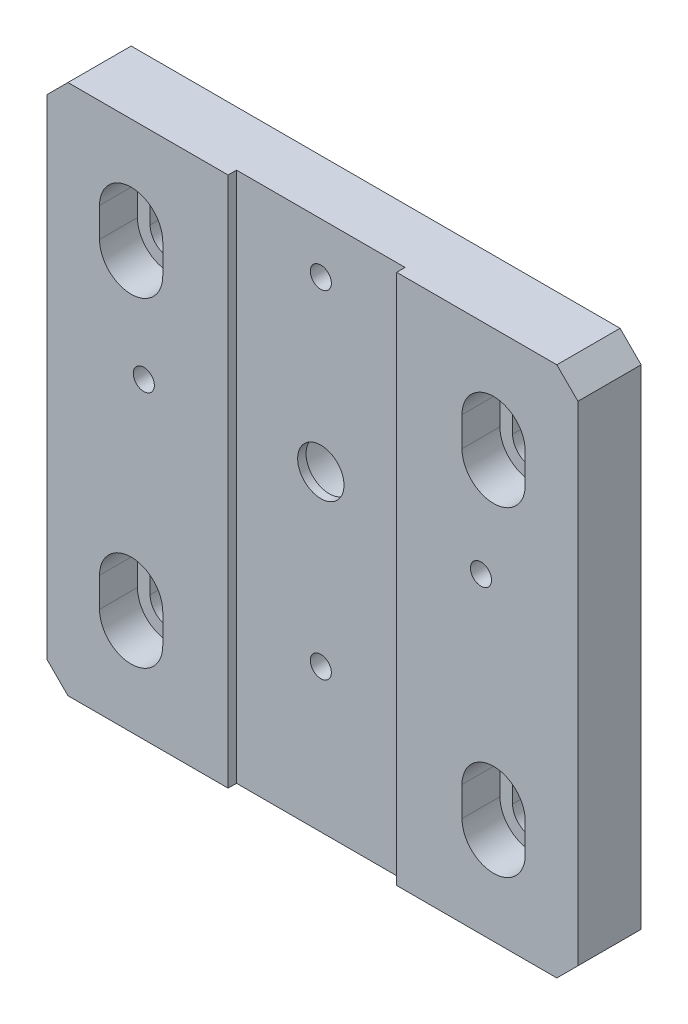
ISO-10303-21;
HEADER;
FILE_DESCRIPTION(('STEP AP214'),'2;1');
FILE_NAME('part.step','',(''),(''),'','','');
FILE_SCHEMA(('AUTOMOTIVE_DESIGN { 1 0 10303 214 1 1 1 1 }'));
ENDSEC;
DATA;
#1=APPLICATION_CONTEXT('core data for automotive mechanical design processes');
#2=APPLICATION_PROTOCOL_DEFINITION('international standard','automotive_design',2000,#1);
#3=PRODUCT_CONTEXT('',#1,'mechanical');
#4=PRODUCT('Part','Part','',(#3));
#5=PRODUCT_RELATED_PRODUCT_CATEGORY('part','',(#4));
#6=PRODUCT_DEFINITION_FORMATION('','',#4);
#7=PRODUCT_DEFINITION_CONTEXT('part definition',#1,'design');
#8=PRODUCT_DEFINITION('design','',#6,#7);
#9=PRODUCT_DEFINITION_SHAPE('','',#8);
#10=(LENGTH_UNIT() NAMED_UNIT(*) SI_UNIT(.MILLI.,.METRE.));
#11=(NAMED_UNIT(*) PLANE_ANGLE_UNIT() SI_UNIT($,.RADIAN.));
#12=(NAMED_UNIT(*) SI_UNIT($,.STERADIAN.) SOLID_ANGLE_UNIT());
#13=UNCERTAINTY_MEASURE_WITH_UNIT(LENGTH_MEASURE(1.E-05),#10,'distance_accuracy_value','');
#14=(GEOMETRIC_REPRESENTATION_CONTEXT(3) GLOBAL_UNCERTAINTY_ASSIGNED_CONTEXT((#13)) GLOBAL_UNIT_ASSIGNED_CONTEXT((#10,
#11,#12)) REPRESENTATION_CONTEXT('',''));
#15=CARTESIAN_POINT('',(0.,0.,0.));
#16=DIRECTION('',(0.,0.,1.));
#17=DIRECTION('',(1.,0.,0.));
#18=AXIS2_PLACEMENT_3D('',#15,#16,#17);
#19=CARTESIAN_POINT('',(0.,0.,15.));
#20=DIRECTION('',(0.,0.,1.));
#21=DIRECTION('',(1.,0.,0.));
#22=AXIS2_PLACEMENT_3D('',#19,#20,#21);
#23=PLANE('',#22);
#24=CARTESIAN_POINT('',(45.5259759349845,86.9103020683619,15.));
#25=DIRECTION('',(0.,0.,1.));
#26=DIRECTION('',(1.,0.,0.));
#27=AXIS2_PLACEMENT_3D('',#24,#25,#26);
#28=CIRCLE('',#27,2.5);
#29=CARTESIAN_POINT('',(48.0259759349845,86.9103020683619,15.));
#30=VERTEX_POINT('',#29);
#31=EDGE_CURVE('E1275',#30,#30,#28,.T.);
#32=ORIENTED_EDGE('',*,*,#31,.F.);
#33=EDGE_LOOP('',(#32));
#34=FACE_BOUND('',#33,.T.);
#35=DIRECTION('',(-1.,0.,0.));
#36=VECTOR('',#35,1.);
#37=CARTESIAN_POINT('',(22.5259759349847,138.910302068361,15.));
#38=LINE('',#37,#36);
#39=CARTESIAN_POINT('',(65.5259759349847,138.910302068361,15.));
#40=VERTEX_POINT('',#39);
#41=CARTESIAN_POINT('',(27.5259759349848,138.910302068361,15.));
#42=VERTEX_POINT('',#41);
#43=EDGE_CURVE('E596',#40,#42,#38,.T.);
#44=ORIENTED_EDGE('',*,*,#43,.T.);
#45=DIRECTION('',(0.70710678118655,0.707106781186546,0.));
#46=VECTOR('',#45,1.);
#47=CARTESIAN_POINT('',(-55.6921630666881,55.6921630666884,15.));
#48=LINE('',#47,#46);
#49=CARTESIAN_POINT('',(22.5259759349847,133.910302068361,15.));
#50=VERTEX_POINT('',#49);
#51=EDGE_CURVE('E629',#42,#50,#48,.F.);
#52=ORIENTED_EDGE('',*,*,#51,.T.);
#53=DIRECTION('',(0.,-1.,0.));
#54=VECTOR('',#53,1.);
#55=CARTESIAN_POINT('',(22.5259759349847,138.910302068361,15.));
#56=LINE('',#55,#54);
#57=CARTESIAN_POINT('',(22.5259759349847,17.9103020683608,15.));
#58=VERTEX_POINT('',#57);
#59=EDGE_CURVE('E587',#50,#58,#56,.T.);
#60=ORIENTED_EDGE('',*,*,#59,.T.);
#61=DIRECTION('',(-0.707106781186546,0.70710678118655,0.));
#62=VECTOR('',#61,1.);
#63=CARTESIAN_POINT('',(20.2181390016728,20.2181390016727,15.));
#64=LINE('',#63,#62);
#65=CARTESIAN_POINT('',(27.5259759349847,12.9103020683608,15.));
#66=VERTEX_POINT('',#65);
#67=EDGE_CURVE('E627',#58,#66,#64,.F.);
#68=ORIENTED_EDGE('',*,*,#67,.T.);
#69=DIRECTION('',(1.,0.,0.));
#70=VECTOR('',#69,1.);
#71=CARTESIAN_POINT('',(22.5259759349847,12.9103020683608,15.));
#72=LINE('',#71,#70);
#73=CARTESIAN_POINT('',(65.5259759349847,12.9103020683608,15.));
#74=VERTEX_POINT('',#73);
#75=EDGE_CURVE('E592',#66,#74,#72,.T.);
#76=ORIENTED_EDGE('',*,*,#75,.T.);
#77=DIRECTION('',(0.,-1.,0.));
#78=VECTOR('',#77,1.);
#79=CARTESIAN_POINT('',(65.5259759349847,138.910302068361,15.));
#80=LINE('',#79,#78);
#81=EDGE_CURVE('E577',#40,#74,#80,.T.);
#82=ORIENTED_EDGE('',*,*,#81,.F.);
#83=EDGE_LOOP('',(#44,#52,#60,#68,#76,#82));
#84=FACE_BOUND('',#83,.T.);
#85=CARTESIAN_POINT('',(42.5259759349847,41.4103020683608,15.));
#86=DIRECTION('',(0.,0.,1.));
#87=DIRECTION('',(1.,0.,0.));
#88=AXIS2_PLACEMENT_3D('',#85,#86,#87);
#89=CIRCLE('',#88,7.5);
#90=CARTESIAN_POINT('',(50.0259759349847,41.4103020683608,15.));
#91=VERTEX_POINT('',#90);
#92=CARTESIAN_POINT('',(35.0259759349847,41.4103020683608,15.));
#93=VERTEX_POINT('',#92);
#94=EDGE_CURVE('E387',#91,#93,#89,.T.);
#95=ORIENTED_EDGE('',*,*,#94,.F.);
#96=DIRECTION('',(0.,-1.,0.));
#97=VECTOR('',#96,1.);
#98=CARTESIAN_POINT('',(50.0259759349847,41.4103020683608,15.));
#99=LINE('',#98,#97);
#100=CARTESIAN_POINT('',(50.0259759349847,34.4103020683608,15.));
#101=VERTEX_POINT('',#100);
#102=EDGE_CURVE('E375',#91,#101,#99,.T.);
#103=ORIENTED_EDGE('',*,*,#102,.T.);
#104=CARTESIAN_POINT('',(42.5259759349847,34.4103020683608,15.));
#105=DIRECTION('',(0.,0.,1.));
#106=DIRECTION('',(1.,0.,0.));
#107=AXIS2_PLACEMENT_3D('',#104,#105,#106);
#108=CIRCLE('',#107,7.5);
#109=CARTESIAN_POINT('',(35.0259759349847,34.4103020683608,15.));
#110=VERTEX_POINT('',#109);
#111=EDGE_CURVE('E407',#110,#101,#108,.T.);
#112=ORIENTED_EDGE('',*,*,#111,.F.);
#113=DIRECTION('',(0.,-1.,0.));
#114=VECTOR('',#113,1.);
#115=CARTESIAN_POINT('',(35.0259759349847,41.4103020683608,15.));
#116=LINE('',#115,#114);
#117=EDGE_CURVE('E358',#93,#110,#116,.T.);
#118=ORIENTED_EDGE('',*,*,#117,.F.);
#119=EDGE_LOOP('',(#95,#103,#112,#118));
#120=FACE_BOUND('',#119,.T.);
#121=CARTESIAN_POINT('',(42.5259759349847,117.410302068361,15.));
#122=DIRECTION('',(0.,0.,1.));
#123=DIRECTION('',(1.,0.,0.));
#124=AXIS2_PLACEMENT_3D('',#121,#122,#123);
#125=CIRCLE('',#124,7.5);
#126=CARTESIAN_POINT('',(50.0259759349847,117.410302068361,15.));
#127=VERTEX_POINT('',#126);
#128=CARTESIAN_POINT('',(35.0259759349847,117.410302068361,15.));
#129=VERTEX_POINT('',#128);
#130=EDGE_CURVE('E317',#127,#129,#125,.T.);
#131=ORIENTED_EDGE('',*,*,#130,.F.);
#132=DIRECTION('',(0.,-1.,0.));
#133=VECTOR('',#132,1.);
#134=CARTESIAN_POINT('',(50.0259759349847,117.410302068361,15.));
#135=LINE('',#134,#133);
#136=CARTESIAN_POINT('',(50.0259759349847,110.410302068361,15.));
#137=VERTEX_POINT('',#136);
#138=EDGE_CURVE('E301',#127,#137,#135,.T.);
#139=ORIENTED_EDGE('',*,*,#138,.T.);
#140=CARTESIAN_POINT('',(42.5259759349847,110.410302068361,15.));
#141=DIRECTION('',(0.,0.,1.));
#142=DIRECTION('',(1.,0.,0.));
#143=AXIS2_PLACEMENT_3D('',#140,#141,#142);
#144=CIRCLE('',#143,7.5);
#145=CARTESIAN_POINT('',(35.0259759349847,110.410302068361,15.));
#146=VERTEX_POINT('',#145);
#147=EDGE_CURVE('E344',#146,#137,#144,.T.);
#148=ORIENTED_EDGE('',*,*,#147,.F.);
#149=DIRECTION('',(0.,-1.,0.));
#150=VECTOR('',#149,1.);
#151=CARTESIAN_POINT('',(35.0259759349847,117.410302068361,15.));
#152=LINE('',#151,#150);
#153=EDGE_CURVE('E324',#129,#146,#152,.T.);
#154=ORIENTED_EDGE('',*,*,#153,.F.);
#155=EDGE_LOOP('',(#131,#139,#148,#154));
#156=FACE_BOUND('',#155,.T.);
#157=ADVANCED_FACE('F16',(#34,#84,#120,#156),#23,.T.);
#158=CARTESIAN_POINT('',(0.,0.,0.));
#159=DIRECTION('',(0.,0.,1.));
#160=DIRECTION('',(1.,0.,0.));
#161=AXIS2_PLACEMENT_3D('',#158,#159,#160);
#162=PLANE('',#161);
#163=CARTESIAN_POINT('',(125.525975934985,86.9103020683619,0.));
#164=DIRECTION('',(0.,0.,1.));
#165=DIRECTION('',(1.,0.,0.));
#166=AXIS2_PLACEMENT_3D('',#163,#164,#165);
#167=CIRCLE('',#166,2.5);
#168=CARTESIAN_POINT('',(128.025975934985,86.9103020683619,0.));
#169=VERTEX_POINT('',#168);
#170=EDGE_CURVE('E1265',#169,#169,#167,.T.);
#171=ORIENTED_EDGE('',*,*,#170,.T.);
#172=EDGE_LOOP('',(#171));
#173=FACE_BOUND('',#172,.T.);
#174=CARTESIAN_POINT('',(85.5259759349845,46.9103020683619,0.));
#175=DIRECTION('',(0.,0.,1.));
#176=DIRECTION('',(1.,0.,0.));
#177=AXIS2_PLACEMENT_3D('',#174,#175,#176);
#178=CIRCLE('',#177,2.5);
#179=CARTESIAN_POINT('',(88.0259759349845,46.9103020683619,0.));
#180=VERTEX_POINT('',#179);
#181=EDGE_CURVE('E1267',#180,#180,#178,.T.);
#182=ORIENTED_EDGE('',*,*,#181,.T.);
#183=EDGE_LOOP('',(#182));
#184=FACE_BOUND('',#183,.T.);
#185=CARTESIAN_POINT('',(45.5259759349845,86.9103020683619,0.));
#186=DIRECTION('',(0.,0.,1.));
#187=DIRECTION('',(1.,0.,0.));
#188=AXIS2_PLACEMENT_3D('',#185,#186,#187);
#189=CIRCLE('',#188,2.5);
#190=CARTESIAN_POINT('',(48.0259759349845,86.9103020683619,0.));
#191=VERTEX_POINT('',#190);
#192=EDGE_CURVE('E1278',#191,#191,#189,.T.);
#193=ORIENTED_EDGE('',*,*,#192,.T.);
#194=EDGE_LOOP('',(#193));
#195=FACE_BOUND('',#194,.T.);
#196=CARTESIAN_POINT('',(85.5259759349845,126.910302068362,0.));
#197=DIRECTION('',(0.,0.,1.));
#198=DIRECTION('',(1.,0.,0.));
#199=AXIS2_PLACEMENT_3D('',#196,#197,#198);
#200=CIRCLE('',#199,2.5);
#201=CARTESIAN_POINT('',(88.0259759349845,126.910302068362,0.));
#202=VERTEX_POINT('',#201);
#203=EDGE_CURVE('E1281',#202,#202,#200,.T.);
#204=ORIENTED_EDGE('',*,*,#203,.T.);
#205=EDGE_LOOP('',(#204));
#206=FACE_BOUND('',#205,.T.);
#207=DIRECTION('',(0.,-1.,0.));
#208=VECTOR('',#207,1.);
#209=CARTESIAN_POINT('',(38.0259759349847,117.410302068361,0.));
#210=LINE('',#209,#208);
#211=CARTESIAN_POINT('',(38.0259759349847,117.410302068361,0.));
#212=VERTEX_POINT('',#211);
#213=CARTESIAN_POINT('',(38.0259759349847,110.410302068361,0.));
#214=VERTEX_POINT('',#213);
#215=EDGE_CURVE('E1292',#212,#214,#210,.T.);
#216=ORIENTED_EDGE('',*,*,#215,.T.);
#217=CARTESIAN_POINT('',(42.5259759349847,110.410302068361,0.));
#218=DIRECTION('',(0.,0.,1.));
#219=DIRECTION('',(1.,0.,0.));
#220=AXIS2_PLACEMENT_3D('',#217,#218,#219);
#221=CIRCLE('',#220,4.5);
#222=CARTESIAN_POINT('',(47.0259759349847,110.410302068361,0.));
#223=VERTEX_POINT('',#222);
#224=EDGE_CURVE('E352',#214,#223,#221,.T.);
#225=ORIENTED_EDGE('',*,*,#224,.T.);
#226=DIRECTION('',(0.,-1.,0.));
#227=VECTOR('',#226,1.);
#228=CARTESIAN_POINT('',(47.0259759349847,117.410302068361,0.));
#229=LINE('',#228,#227);
#230=CARTESIAN_POINT('',(47.0259759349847,117.410302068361,0.));
#231=VERTEX_POINT('',#230);
#232=EDGE_CURVE('E1295',#231,#223,#229,.T.);
#233=ORIENTED_EDGE('',*,*,#232,.F.);
#234=CARTESIAN_POINT('',(42.5259759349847,117.410302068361,0.));
#235=DIRECTION('',(0.,0.,1.));
#236=DIRECTION('',(1.,0.,0.));
#237=AXIS2_PLACEMENT_3D('',#234,#235,#236);
#238=CIRCLE('',#237,4.5);
#239=EDGE_CURVE('E333',#231,#212,#238,.T.);
#240=ORIENTED_EDGE('',*,*,#239,.T.);
#241=EDGE_LOOP('',(#216,#225,#233,#240));
#242=FACE_BOUND('',#241,.T.);
#243=DIRECTION('',(0.,-1.,0.));
#244=VECTOR('',#243,1.);
#245=CARTESIAN_POINT('',(38.0259759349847,41.4103020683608,0.));
#246=LINE('',#245,#244);
#247=CARTESIAN_POINT('',(38.0259759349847,41.4103020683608,0.));
#248=VERTEX_POINT('',#247);
#249=CARTESIAN_POINT('',(38.0259759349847,34.4103020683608,0.));
#250=VERTEX_POINT('',#249);
#251=EDGE_CURVE('E364',#248,#250,#246,.T.);
#252=ORIENTED_EDGE('',*,*,#251,.T.);
#253=CARTESIAN_POINT('',(42.5259759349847,34.4103020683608,0.));
#254=DIRECTION('',(0.,0.,1.));
#255=DIRECTION('',(1.,0.,0.));
#256=AXIS2_PLACEMENT_3D('',#253,#254,#255);
#257=CIRCLE('',#256,4.5);
#258=CARTESIAN_POINT('',(47.0259759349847,34.4103020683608,0.));
#259=VERTEX_POINT('',#258);
#260=EDGE_CURVE('E415',#250,#259,#257,.T.);
#261=ORIENTED_EDGE('',*,*,#260,.T.);
#262=DIRECTION('',(0.,-1.,0.));
#263=VECTOR('',#262,1.);
#264=CARTESIAN_POINT('',(47.0259759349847,41.4103020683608,0.));
#265=LINE('',#264,#263);
#266=CARTESIAN_POINT('',(47.0259759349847,41.4103020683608,0.));
#267=VERTEX_POINT('',#266);
#268=EDGE_CURVE('E367',#267,#259,#265,.T.);
#269=ORIENTED_EDGE('',*,*,#268,.F.);
#270=CARTESIAN_POINT('',(42.5259759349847,41.4103020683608,0.));
#271=DIRECTION('',(0.,0.,1.));
#272=DIRECTION('',(1.,0.,0.));
#273=AXIS2_PLACEMENT_3D('',#270,#271,#272);
#274=CIRCLE('',#273,4.5);
#275=EDGE_CURVE('E395',#267,#248,#274,.T.);
#276=ORIENTED_EDGE('',*,*,#275,.T.);
#277=EDGE_LOOP('',(#252,#261,#269,#276));
#278=FACE_BOUND('',#277,.T.);
#279=DIRECTION('',(0.,-1.,0.));
#280=VECTOR('',#279,1.);
#281=CARTESIAN_POINT('',(133.025975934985,41.4103020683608,0.));
#282=LINE('',#281,#280);
#283=CARTESIAN_POINT('',(133.025975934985,41.4103020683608,0.));
#284=VERTEX_POINT('',#283);
#285=CARTESIAN_POINT('',(133.025975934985,34.4103020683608,0.));
#286=VERTEX_POINT('',#285);
#287=EDGE_CURVE('E494',#284,#286,#282,.T.);
#288=ORIENTED_EDGE('',*,*,#287,.F.);
#289=CARTESIAN_POINT('',(128.525975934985,41.4103020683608,0.));
#290=DIRECTION('',(0.,0.,1.));
#291=DIRECTION('',(1.,0.,0.));
#292=AXIS2_PLACEMENT_3D('',#289,#290,#291);
#293=CIRCLE('',#292,4.5);
#294=CARTESIAN_POINT('',(124.025975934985,41.4103020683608,0.));
#295=VERTEX_POINT('',#294);
#296=EDGE_CURVE('E522',#284,#295,#293,.T.);
#297=ORIENTED_EDGE('',*,*,#296,.T.);
#298=DIRECTION('',(0.,-1.,0.));
#299=VECTOR('',#298,1.);
#300=CARTESIAN_POINT('',(124.025975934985,41.4103020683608,0.));
#301=LINE('',#300,#299);
#302=CARTESIAN_POINT('',(124.025975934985,34.4103020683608,0.));
#303=VERTEX_POINT('',#302);
#304=EDGE_CURVE('E491',#295,#303,#301,.T.);
#305=ORIENTED_EDGE('',*,*,#304,.T.);
#306=CARTESIAN_POINT('',(128.525975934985,34.4103020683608,0.));
#307=DIRECTION('',(0.,0.,1.));
#308=DIRECTION('',(1.,0.,0.));
#309=AXIS2_PLACEMENT_3D('',#306,#307,#308);
#310=CIRCLE('',#309,4.5);
#311=EDGE_CURVE('E543',#303,#286,#310,.T.);
#312=ORIENTED_EDGE('',*,*,#311,.T.);
#313=EDGE_LOOP('',(#288,#297,#305,#312));
#314=FACE_BOUND('',#313,.T.);
#315=CARTESIAN_POINT('',(85.5259759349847,86.9103020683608,0.));
#316=DIRECTION('',(0.,0.,-1.));
#317=DIRECTION('',(-1.,0.,0.));
#318=AXIS2_PLACEMENT_3D('',#315,#316,#317);
#319=CIRCLE('',#318,9.);
#320=CARTESIAN_POINT('',(76.5259759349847,86.9103020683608,0.));
#321=VERTEX_POINT('',#320);
#322=EDGE_CURVE('E549',#321,#321,#319,.T.);
#323=ORIENTED_EDGE('',*,*,#322,.F.);
#324=EDGE_LOOP('',(#323));
#325=FACE_BOUND('',#324,.T.);
#326=DIRECTION('',(0.,-1.,0.));
#327=VECTOR('',#326,1.);
#328=CARTESIAN_POINT('',(22.5259759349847,138.910302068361,0.));
#329=LINE('',#328,#327);
#330=CARTESIAN_POINT('',(22.5259759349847,133.910302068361,0.));
#331=VERTEX_POINT('',#330);
#332=CARTESIAN_POINT('',(22.5259759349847,17.9103020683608,0.));
#333=VERTEX_POINT('',#332);
#334=EDGE_CURVE('E580',#331,#333,#329,.T.);
#335=ORIENTED_EDGE('',*,*,#334,.F.);
#336=DIRECTION('',(-0.70710678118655,-0.707106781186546,0.));
#337=VECTOR('',#336,1.);
#338=CARTESIAN_POINT('',(22.5259759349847,133.910302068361,0.));
#339=LINE('',#338,#337);
#340=CARTESIAN_POINT('',(27.5259759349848,138.910302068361,0.));
#341=VERTEX_POINT('',#340);
#342=EDGE_CURVE('E620',#331,#341,#339,.F.);
#343=ORIENTED_EDGE('',*,*,#342,.T.);
#344=DIRECTION('',(-1.,0.,0.));
#345=VECTOR('',#344,1.);
#346=CARTESIAN_POINT('',(22.5259759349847,138.910302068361,0.));
#347=LINE('',#346,#345);
#348=CARTESIAN_POINT('',(143.525975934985,138.910302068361,0.));
#349=VERTEX_POINT('',#348);
#350=EDGE_CURVE('E591',#349,#341,#347,.T.);
#351=ORIENTED_EDGE('',*,*,#350,.F.);
#352=DIRECTION('',(-0.707106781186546,0.70710678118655,0.));
#353=VECTOR('',#352,1.);
#354=CARTESIAN_POINT('',(143.525975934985,138.910302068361,0.));
#355=LINE('',#354,#353);
#356=CARTESIAN_POINT('',(148.525975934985,133.910302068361,0.));
#357=VERTEX_POINT('',#356);
#358=EDGE_CURVE('E618',#349,#357,#355,.F.);
#359=ORIENTED_EDGE('',*,*,#358,.T.);
#360=DIRECTION('',(0.,1.,0.));
#361=VECTOR('',#360,1.);
#362=CARTESIAN_POINT('',(148.525975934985,138.910302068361,0.));
#363=LINE('',#362,#361);
#364=CARTESIAN_POINT('',(148.525975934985,17.9103020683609,0.));
#365=VERTEX_POINT('',#364);
#366=EDGE_CURVE('E604',#365,#357,#363,.T.);
#367=ORIENTED_EDGE('',*,*,#366,.F.);
#368=DIRECTION('',(0.707106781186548,0.707106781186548,0.));
#369=VECTOR('',#368,1.);
#370=CARTESIAN_POINT('',(148.525975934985,17.9103020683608,0.));
#371=LINE('',#370,#369);
#372=CARTESIAN_POINT('',(143.525975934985,12.9103020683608,0.));
#373=VERTEX_POINT('',#372);
#374=EDGE_CURVE('E614',#365,#373,#371,.F.);
#375=ORIENTED_EDGE('',*,*,#374,.T.);
#376=DIRECTION('',(1.,0.,0.));
#377=VECTOR('',#376,1.);
#378=CARTESIAN_POINT('',(22.5259759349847,12.9103020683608,0.));
#379=LINE('',#378,#377);
#380=CARTESIAN_POINT('',(27.5259759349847,12.9103020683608,0.));
#381=VERTEX_POINT('',#380);
#382=EDGE_CURVE('E602',#381,#373,#379,.T.);
#383=ORIENTED_EDGE('',*,*,#382,.F.);
#384=DIRECTION('',(0.707106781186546,-0.70710678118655,0.));
#385=VECTOR('',#384,1.);
#386=CARTESIAN_POINT('',(27.5259759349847,12.9103020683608,0.));
#387=LINE('',#386,#385);
#388=EDGE_CURVE('E616',#381,#333,#387,.F.);
#389=ORIENTED_EDGE('',*,*,#388,.T.);
#390=EDGE_LOOP('',(#335,#343,#351,#359,#367,#375,#383,#389));
#391=FACE_BOUND('',#390,.T.);
#392=DIRECTION('',(0.,-1.,0.));
#393=VECTOR('',#392,1.);
#394=CARTESIAN_POINT('',(133.025975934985,117.410302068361,0.));
#395=LINE('',#394,#393);
#396=CARTESIAN_POINT('',(133.025975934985,117.410302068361,0.));
#397=VERTEX_POINT('',#396);
#398=CARTESIAN_POINT('',(133.025975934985,110.410302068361,0.));
#399=VERTEX_POINT('',#398);
#400=EDGE_CURVE('E430',#397,#399,#395,.T.);
#401=ORIENTED_EDGE('',*,*,#400,.F.);
#402=CARTESIAN_POINT('',(128.525975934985,117.410302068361,0.));
#403=DIRECTION('',(0.,0.,1.));
#404=DIRECTION('',(1.,0.,0.));
#405=AXIS2_PLACEMENT_3D('',#402,#403,#404);
#406=CIRCLE('',#405,4.5);
#407=CARTESIAN_POINT('',(124.025975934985,117.410302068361,0.));
#408=VERTEX_POINT('',#407);
#409=EDGE_CURVE('E458',#397,#408,#406,.T.);
#410=ORIENTED_EDGE('',*,*,#409,.T.);
#411=DIRECTION('',(0.,-1.,0.));
#412=VECTOR('',#411,1.);
#413=CARTESIAN_POINT('',(124.025975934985,117.410302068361,0.));
#414=LINE('',#413,#412);
#415=CARTESIAN_POINT('',(124.025975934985,110.410302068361,0.));
#416=VERTEX_POINT('',#415);
#417=EDGE_CURVE('E427',#408,#416,#414,.T.);
#418=ORIENTED_EDGE('',*,*,#417,.T.);
#419=CARTESIAN_POINT('',(128.525975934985,110.410302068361,0.));
#420=DIRECTION('',(0.,0.,1.));
#421=DIRECTION('',(1.,0.,0.));
#422=AXIS2_PLACEMENT_3D('',#419,#420,#421);
#423=CIRCLE('',#422,4.5);
#424=EDGE_CURVE('E479',#416,#399,#423,.T.);
#425=ORIENTED_EDGE('',*,*,#424,.T.);
#426=EDGE_LOOP('',(#401,#410,#418,#425));
#427=FACE_BOUND('',#426,.T.);
#428=ADVANCED_FACE('F654',(#173,#184,#195,#206,#242,#278,#314,#325,#391,#427),#162,.F.);
#429=CARTESIAN_POINT('',(125.525975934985,86.9103020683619,15.));
#430=DIRECTION('',(0.,0.,1.));
#431=DIRECTION('',(1.,0.,0.));
#432=AXIS2_PLACEMENT_3D('',#429,#430,#431);
#433=CIRCLE('',#432,2.5);
#434=CARTESIAN_POINT('',(128.025975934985,86.9103020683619,15.));
#435=VERTEX_POINT('',#434);
#436=EDGE_CURVE('E724',#435,#435,#433,.T.);
#437=ORIENTED_EDGE('',*,*,#436,.F.);
#438=EDGE_LOOP('',(#437));
#439=FACE_BOUND('',#438,.T.);
#440=CARTESIAN_POINT('',(128.525975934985,110.410302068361,15.));
#441=DIRECTION('',(0.,0.,1.));
#442=DIRECTION('',(1.,0.,0.));
#443=AXIS2_PLACEMENT_3D('',#440,#441,#442);
#444=CIRCLE('',#443,7.5);
#445=CARTESIAN_POINT('',(121.025975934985,110.410302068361,15.));
#446=VERTEX_POINT('',#445);
#447=CARTESIAN_POINT('',(136.025975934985,110.410302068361,15.));
#448=VERTEX_POINT('',#447);
#449=EDGE_CURVE('E471',#446,#448,#444,.T.);
#450=ORIENTED_EDGE('',*,*,#449,.F.);
#451=DIRECTION('',(0.,-1.,0.));
#452=VECTOR('',#451,1.);
#453=CARTESIAN_POINT('',(121.025975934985,117.410302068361,15.));
#454=LINE('',#453,#452);
#455=CARTESIAN_POINT('',(121.025975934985,117.410302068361,15.));
#456=VERTEX_POINT('',#455);
#457=EDGE_CURVE('E421',#456,#446,#454,.T.);
#458=ORIENTED_EDGE('',*,*,#457,.F.);
#459=CARTESIAN_POINT('',(128.525975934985,117.410302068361,15.));
#460=DIRECTION('',(0.,0.,1.));
#461=DIRECTION('',(1.,0.,0.));
#462=AXIS2_PLACEMENT_3D('',#459,#460,#461);
#463=CIRCLE('',#462,7.5);
#464=CARTESIAN_POINT('',(136.025975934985,117.410302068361,15.));
#465=VERTEX_POINT('',#464);
#466=EDGE_CURVE('E450',#465,#456,#463,.T.);
#467=ORIENTED_EDGE('',*,*,#466,.F.);
#468=DIRECTION('',(0.,-1.,0.));
#469=VECTOR('',#468,1.);
#470=CARTESIAN_POINT('',(136.025975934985,117.410302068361,15.));
#471=LINE('',#470,#469);
#472=EDGE_CURVE('E438',#465,#448,#471,.T.);
#473=ORIENTED_EDGE('',*,*,#472,.T.);
#474=EDGE_LOOP('',(#450,#458,#467,#473));
#475=FACE_BOUND('',#474,.T.);
#476=DIRECTION('',(0.,1.,0.));
#477=VECTOR('',#476,1.);
#478=CARTESIAN_POINT('',(148.525975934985,138.910302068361,15.));
#479=LINE('',#478,#477);
#480=CARTESIAN_POINT('',(148.525975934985,17.9103020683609,15.));
#481=VERTEX_POINT('',#480);
#482=CARTESIAN_POINT('',(148.525975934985,133.910302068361,15.));
#483=VERTEX_POINT('',#482);
#484=EDGE_CURVE('E594',#481,#483,#479,.T.);
#485=ORIENTED_EDGE('',*,*,#484,.T.);
#486=DIRECTION('',(0.707106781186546,-0.70710678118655,0.));
#487=VECTOR('',#486,1.);
#488=CARTESIAN_POINT('',(141.218139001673,141.218139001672,15.));
#489=LINE('',#488,#487);
#490=CARTESIAN_POINT('',(143.525975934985,138.910302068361,15.));
#491=VERTEX_POINT('',#490);
#492=EDGE_CURVE('E637',#483,#491,#489,.F.);
#493=ORIENTED_EDGE('',*,*,#492,.T.);
#494=CARTESIAN_POINT('',(105.525975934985,138.910302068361,15.));
#495=VERTEX_POINT('',#494);
#496=EDGE_CURVE('E597',#491,#495,#38,.T.);
#497=ORIENTED_EDGE('',*,*,#496,.T.);
#498=DIRECTION('',(0.,-1.,0.));
#499=VECTOR('',#498,1.);
#500=CARTESIAN_POINT('',(105.525975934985,138.910302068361,15.));
#501=LINE('',#500,#499);
#502=CARTESIAN_POINT('',(105.525975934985,12.9103020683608,15.));
#503=VERTEX_POINT('',#502);
#504=EDGE_CURVE('E581',#495,#503,#501,.T.);
#505=ORIENTED_EDGE('',*,*,#504,.T.);
#506=CARTESIAN_POINT('',(143.525975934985,12.9103020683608,15.));
#507=VERTEX_POINT('',#506);
#508=EDGE_CURVE('E590',#503,#507,#72,.T.);
#509=ORIENTED_EDGE('',*,*,#508,.T.);
#510=DIRECTION('',(-0.707106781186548,-0.707106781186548,0.));
#511=VECTOR('',#510,1.);
#512=CARTESIAN_POINT('',(65.307836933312,-65.307836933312,15.));
#513=LINE('',#512,#511);
#514=EDGE_CURVE('E635',#507,#481,#513,.F.);
#515=ORIENTED_EDGE('',*,*,#514,.T.);
#516=EDGE_LOOP('',(#485,#493,#497,#505,#509,#515));
#517=FACE_BOUND('',#516,.T.);
#518=CARTESIAN_POINT('',(128.525975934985,41.4103020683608,15.));
#519=DIRECTION('',(0.,0.,1.));
#520=DIRECTION('',(1.,0.,0.));
#521=AXIS2_PLACEMENT_3D('',#518,#519,#520);
#522=CIRCLE('',#521,7.5);
#523=CARTESIAN_POINT('',(136.025975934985,41.4103020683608,15.));
#524=VERTEX_POINT('',#523);
#525=CARTESIAN_POINT('',(121.025975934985,41.4103020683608,15.));
#526=VERTEX_POINT('',#525);
#527=EDGE_CURVE('E514',#524,#526,#522,.T.);
#528=ORIENTED_EDGE('',*,*,#527,.F.);
#529=DIRECTION('',(0.,-1.,0.));
#530=VECTOR('',#529,1.);
#531=CARTESIAN_POINT('',(136.025975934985,41.4103020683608,15.));
#532=LINE('',#531,#530);
#533=CARTESIAN_POINT('',(136.025975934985,34.4103020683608,15.));
#534=VERTEX_POINT('',#533);
#535=EDGE_CURVE('E502',#524,#534,#532,.T.);
#536=ORIENTED_EDGE('',*,*,#535,.T.);
#537=CARTESIAN_POINT('',(128.525975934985,34.4103020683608,15.));
#538=DIRECTION('',(0.,0.,1.));
#539=DIRECTION('',(1.,0.,0.));
#540=AXIS2_PLACEMENT_3D('',#537,#538,#539);
#541=CIRCLE('',#540,7.5);
#542=CARTESIAN_POINT('',(121.025975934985,34.4103020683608,15.));
#543=VERTEX_POINT('',#542);
#544=EDGE_CURVE('E535',#543,#534,#541,.T.);
#545=ORIENTED_EDGE('',*,*,#544,.F.);
#546=DIRECTION('',(0.,-1.,0.));
#547=VECTOR('',#546,1.);
#548=CARTESIAN_POINT('',(121.025975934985,41.4103020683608,15.));
#549=LINE('',#548,#547);
#550=EDGE_CURVE('E485',#526,#543,#549,.T.);
#551=ORIENTED_EDGE('',*,*,#550,.F.);
#552=EDGE_LOOP('',(#528,#536,#545,#551));
#553=FACE_BOUND('',#552,.T.);
#554=ADVANCED_FACE('F641',(#439,#475,#517,#553),#23,.T.);
#555=CARTESIAN_POINT('',(22.5259759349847,138.910302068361,15.));
#556=DIRECTION('',(1.,0.,0.));
#557=DIRECTION('',(0.,1.,0.));
#558=AXIS2_PLACEMENT_3D('',#555,#556,#557);
#559=PLANE('',#558);
#560=ORIENTED_EDGE('',*,*,#59,.F.);
#561=DIRECTION('',(0.,0.,-1.));
#562=VECTOR('',#561,1.);
#563=CARTESIAN_POINT('',(22.5259759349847,133.910302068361,15.));
#564=LINE('',#563,#562);
#565=EDGE_CURVE('E611',#50,#331,#564,.T.);
#566=ORIENTED_EDGE('',*,*,#565,.T.);
#567=ORIENTED_EDGE('',*,*,#334,.T.);
#568=DIRECTION('',(0.,0.,1.));
#569=VECTOR('',#568,1.);
#570=CARTESIAN_POINT('',(22.5259759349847,17.9103020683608,15.));
#571=LINE('',#570,#569);
#572=EDGE_CURVE('E599',#333,#58,#571,.T.);
#573=ORIENTED_EDGE('',*,*,#572,.T.);
#574=EDGE_LOOP('',(#560,#566,#567,#573));
#575=FACE_BOUND('',#574,.T.);
#576=ADVANCED_FACE('F671',(#575),#559,.F.);
#577=CARTESIAN_POINT('',(22.5259759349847,12.9103020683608,15.));
#578=DIRECTION('',(0.,1.,0.));
#579=DIRECTION('',(0.,0.,1.));
#580=AXIS2_PLACEMENT_3D('',#577,#578,#579);
#581=PLANE('',#580);
#582=ORIENTED_EDGE('',*,*,#75,.F.);
#583=DIRECTION('',(0.,0.,-1.));
#584=VECTOR('',#583,1.);
#585=CARTESIAN_POINT('',(27.5259759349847,12.9103020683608,15.));
#586=LINE('',#585,#584);
#587=EDGE_CURVE('E11',#66,#381,#586,.T.);
#588=ORIENTED_EDGE('',*,*,#587,.T.);
#589=ORIENTED_EDGE('',*,*,#382,.T.);
#590=DIRECTION('',(0.,0.,1.));
#591=VECTOR('',#590,1.);
#592=CARTESIAN_POINT('',(143.525975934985,12.9103020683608,15.));
#593=LINE('',#592,#591);
#594=EDGE_CURVE('E24',#373,#507,#593,.T.);
#595=ORIENTED_EDGE('',*,*,#594,.T.);
#596=ORIENTED_EDGE('',*,*,#508,.F.);
#597=DIRECTION('',(0.,0.,1.));
#598=VECTOR('',#597,1.);
#599=CARTESIAN_POINT('',(105.525975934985,12.9103020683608,15.));
#600=LINE('',#599,#598);
#601=CARTESIAN_POINT('',(105.525975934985,12.9103020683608,13.));
#602=VERTEX_POINT('',#601);
#603=EDGE_CURVE('E563',#602,#503,#600,.T.);
#604=ORIENTED_EDGE('',*,*,#603,.F.);
#605=DIRECTION('',(1.,0.,0.));
#606=VECTOR('',#605,1.);
#607=CARTESIAN_POINT('',(65.5259759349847,12.9103020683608,13.));
#608=LINE('',#607,#606);
#609=CARTESIAN_POINT('',(65.5259759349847,12.9103020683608,13.));
#610=VERTEX_POINT('',#609);
#611=EDGE_CURVE('E573',#610,#602,#608,.T.);
#612=ORIENTED_EDGE('',*,*,#611,.F.);
#613=DIRECTION('',(0.,0.,-1.));
#614=VECTOR('',#613,1.);
#615=CARTESIAN_POINT('',(65.5259759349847,12.9103020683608,15.));
#616=LINE('',#615,#614);
#617=EDGE_CURVE('E570',#74,#610,#616,.T.);
#618=ORIENTED_EDGE('',*,*,#617,.F.);
#619=EDGE_LOOP('',(#582,#588,#589,#595,#596,#604,#612,#618));
#620=FACE_BOUND('',#619,.T.);
#621=ADVANCED_FACE('F662',(#620),#581,.F.);
#622=CARTESIAN_POINT('',(148.525975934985,138.910302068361,15.));
#623=DIRECTION('',(-1.,0.,0.));
#624=DIRECTION('',(0.,-1.,0.));
#625=AXIS2_PLACEMENT_3D('',#622,#623,#624);
#626=PLANE('',#625);
#627=ORIENTED_EDGE('',*,*,#366,.T.);
#628=DIRECTION('',(0.,0.,1.));
#629=VECTOR('',#628,1.);
#630=CARTESIAN_POINT('',(148.525975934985,133.910302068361,15.));
#631=LINE('',#630,#629);
#632=EDGE_CURVE('E38',#357,#483,#631,.T.);
#633=ORIENTED_EDGE('',*,*,#632,.T.);
#634=ORIENTED_EDGE('',*,*,#484,.F.);
#635=DIRECTION('',(0.,0.,-1.));
#636=VECTOR('',#635,1.);
#637=CARTESIAN_POINT('',(148.525975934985,17.9103020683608,15.));
#638=LINE('',#637,#636);
#639=EDGE_CURVE('E631',#481,#365,#638,.T.);
#640=ORIENTED_EDGE('',*,*,#639,.T.);
#641=EDGE_LOOP('',(#627,#633,#634,#640));
#642=FACE_BOUND('',#641,.T.);
#643=ADVANCED_FACE('F656',(#642),#626,.F.);
#644=CARTESIAN_POINT('',(22.5259759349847,138.910302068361,15.));
#645=DIRECTION('',(0.,-1.,0.));
#646=DIRECTION('',(0.,0.,-1.));
#647=AXIS2_PLACEMENT_3D('',#644,#645,#646);
#648=PLANE('',#647);
#649=ORIENTED_EDGE('',*,*,#350,.T.);
#650=DIRECTION('',(0.,0.,1.));
#651=VECTOR('',#650,1.);
#652=CARTESIAN_POINT('',(27.5259759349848,138.910302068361,15.));
#653=LINE('',#652,#651);
#654=EDGE_CURVE('E625',#341,#42,#653,.T.);
#655=ORIENTED_EDGE('',*,*,#654,.T.);
#656=ORIENTED_EDGE('',*,*,#43,.F.);
#657=DIRECTION('',(0.,0.,-1.));
#658=VECTOR('',#657,1.);
#659=CARTESIAN_POINT('',(65.5259759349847,138.910302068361,15.));
#660=LINE('',#659,#658);
#661=CARTESIAN_POINT('',(65.5259759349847,138.910302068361,13.));
#662=VERTEX_POINT('',#661);
#663=EDGE_CURVE('E559',#40,#662,#660,.T.);
#664=ORIENTED_EDGE('',*,*,#663,.T.);
#665=DIRECTION('',(1.,0.,0.));
#666=VECTOR('',#665,1.);
#667=CARTESIAN_POINT('',(65.5259759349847,138.910302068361,13.));
#668=LINE('',#667,#666);
#669=CARTESIAN_POINT('',(105.525975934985,138.910302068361,13.));
#670=VERTEX_POINT('',#669);
#671=EDGE_CURVE('E562',#662,#670,#668,.T.);
#672=ORIENTED_EDGE('',*,*,#671,.T.);
#673=DIRECTION('',(0.,0.,1.));
#674=VECTOR('',#673,1.);
#675=CARTESIAN_POINT('',(105.525975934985,138.910302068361,15.));
#676=LINE('',#675,#674);
#677=EDGE_CURVE('E566',#670,#495,#676,.T.);
#678=ORIENTED_EDGE('',*,*,#677,.T.);
#679=ORIENTED_EDGE('',*,*,#496,.F.);
#680=DIRECTION('',(0.,0.,-1.));
#681=VECTOR('',#680,1.);
#682=CARTESIAN_POINT('',(143.525975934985,138.910302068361,15.));
#683=LINE('',#682,#681);
#684=EDGE_CURVE('E622',#491,#349,#683,.T.);
#685=ORIENTED_EDGE('',*,*,#684,.T.);
#686=EDGE_LOOP('',(#649,#655,#656,#664,#672,#678,#679,#685));
#687=FACE_BOUND('',#686,.T.);
#688=ADVANCED_FACE('F647',(#687),#648,.F.);
#689=CARTESIAN_POINT('',(65.5259759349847,138.910302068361,15.));
#690=DIRECTION('',(-1.,0.,0.));
#691=DIRECTION('',(0.,0.,1.));
#692=AXIS2_PLACEMENT_3D('',#689,#690,#691);
#693=PLANE('',#692);
#694=ORIENTED_EDGE('',*,*,#617,.T.);
#695=DIRECTION('',(0.,-1.,0.));
#696=VECTOR('',#695,1.);
#697=CARTESIAN_POINT('',(65.5259759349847,138.910302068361,13.));
#698=LINE('',#697,#696);
#699=EDGE_CURVE('E569',#662,#610,#698,.T.);
#700=ORIENTED_EDGE('',*,*,#699,.F.);
#701=ORIENTED_EDGE('',*,*,#663,.F.);
#702=ORIENTED_EDGE('',*,*,#81,.T.);
#703=EDGE_LOOP('',(#694,#700,#701,#702));
#704=FACE_BOUND('',#703,.T.);
#705=ADVANCED_FACE('F683',(#704),#693,.F.);
#706=CARTESIAN_POINT('',(105.525975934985,138.910302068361,15.));
#707=DIRECTION('',(1.,0.,0.));
#708=DIRECTION('',(0.,0.,-1.));
#709=AXIS2_PLACEMENT_3D('',#706,#707,#708);
#710=PLANE('',#709);
#711=ORIENTED_EDGE('',*,*,#603,.T.);
#712=ORIENTED_EDGE('',*,*,#504,.F.);
#713=ORIENTED_EDGE('',*,*,#677,.F.);
#714=DIRECTION('',(0.,-1.,0.));
#715=VECTOR('',#714,1.);
#716=CARTESIAN_POINT('',(105.525975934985,138.910302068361,13.));
#717=LINE('',#716,#715);
#718=EDGE_CURVE('E584',#670,#602,#717,.T.);
#719=ORIENTED_EDGE('',*,*,#718,.T.);
#720=EDGE_LOOP('',(#711,#712,#713,#719));
#721=FACE_BOUND('',#720,.T.);
#722=ADVANCED_FACE('F690',(#721),#710,.F.);
#723=CARTESIAN_POINT('',(65.5259759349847,138.910302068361,13.));
#724=DIRECTION('',(0.,0.,-1.));
#725=DIRECTION('',(-1.,0.,0.));
#726=AXIS2_PLACEMENT_3D('',#723,#724,#725);
#727=PLANE('',#726);
#728=CARTESIAN_POINT('',(85.5259759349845,46.9103020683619,13.));
#729=DIRECTION('',(0.,0.,-1.));
#730=DIRECTION('',(-1.,0.,0.));
#731=AXIS2_PLACEMENT_3D('',#728,#729,#730);
#732=CIRCLE('',#731,2.5);
#733=CARTESIAN_POINT('',(83.0259759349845,46.9103020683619,13.));
#734=VERTEX_POINT('',#733);
#735=EDGE_CURVE('E1272',#734,#734,#732,.T.);
#736=ORIENTED_EDGE('',*,*,#735,.T.);
#737=EDGE_LOOP('',(#736));
#738=FACE_BOUND('',#737,.T.);
#739=CARTESIAN_POINT('',(85.5259759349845,126.910302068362,13.));
#740=DIRECTION('',(0.,0.,-1.));
#741=DIRECTION('',(-1.,0.,0.));
#742=AXIS2_PLACEMENT_3D('',#739,#740,#741);
#743=CIRCLE('',#742,2.5);
#744=CARTESIAN_POINT('',(83.0259759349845,126.910302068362,13.));
#745=VERTEX_POINT('',#744);
#746=EDGE_CURVE('E1284',#745,#745,#743,.T.);
#747=ORIENTED_EDGE('',*,*,#746,.T.);
#748=EDGE_LOOP('',(#747));
#749=FACE_BOUND('',#748,.T.);
#750=CARTESIAN_POINT('',(85.5259759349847,86.9103020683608,13.));
#751=DIRECTION('',(0.,0.,-1.));
#752=DIRECTION('',(-1.,0.,0.));
#753=AXIS2_PLACEMENT_3D('',#750,#751,#752);
#754=CIRCLE('',#753,5.5);
#755=CARTESIAN_POINT('',(80.0259759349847,86.9103020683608,13.));
#756=VERTEX_POINT('',#755);
#757=EDGE_CURVE('E558',#756,#756,#754,.T.);
#758=ORIENTED_EDGE('',*,*,#757,.T.);
#759=EDGE_LOOP('',(#758));
#760=FACE_BOUND('',#759,.T.);
#761=ORIENTED_EDGE('',*,*,#611,.T.);
#762=ORIENTED_EDGE('',*,*,#718,.F.);
#763=ORIENTED_EDGE('',*,*,#671,.F.);
#764=ORIENTED_EDGE('',*,*,#699,.T.);
#765=EDGE_LOOP('',(#761,#762,#763,#764));
#766=FACE_BOUND('',#765,.T.);
#767=ADVANCED_FACE('F687',(#738,#749,#760,#766),#727,.F.);
#768=CARTESIAN_POINT('',(85.5259759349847,86.9103020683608,0.));
#769=DIRECTION('',(0.,0.,-1.));
#770=DIRECTION('',(-1.,0.,0.));
#771=AXIS2_PLACEMENT_3D('',#768,#769,#770);
#772=CYLINDRICAL_SURFACE('',#771,5.5);
#773=CARTESIAN_POINT('',(85.5259759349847,86.9103020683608,11.));
#774=DIRECTION('',(0.,0.,-1.));
#775=DIRECTION('',(-1.,0.,0.));
#776=AXIS2_PLACEMENT_3D('',#773,#774,#775);
#777=CIRCLE('',#776,5.5);
#778=CARTESIAN_POINT('',(80.0259759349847,86.9103020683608,11.));
#779=VERTEX_POINT('',#778);
#780=EDGE_CURVE('E555',#779,#779,#777,.T.);
#781=ORIENTED_EDGE('',*,*,#780,.T.);
#782=EDGE_LOOP('',(#781));
#783=FACE_BOUND('',#782,.T.);
#784=ORIENTED_EDGE('',*,*,#757,.F.);
#785=EDGE_LOOP('',(#784));
#786=FACE_BOUND('',#785,.T.);
#787=ADVANCED_FACE('F699',(#783,#786),#772,.F.);
#788=CARTESIAN_POINT('',(91.0259759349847,86.9103020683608,11.));
#789=DIRECTION('',(0.,0.,1.));
#790=DIRECTION('',(1.,0.,0.));
#791=AXIS2_PLACEMENT_3D('',#788,#789,#790);
#792=PLANE('',#791);
#793=ORIENTED_EDGE('',*,*,#780,.F.);
#794=EDGE_LOOP('',(#793));
#795=FACE_BOUND('',#794,.T.);
#796=CARTESIAN_POINT('',(85.5259759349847,86.9103020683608,11.));
#797=DIRECTION('',(0.,0.,-1.));
#798=DIRECTION('',(-1.,0.,0.));
#799=AXIS2_PLACEMENT_3D('',#796,#797,#798);
#800=CIRCLE('',#799,9.);
#801=CARTESIAN_POINT('',(76.5259759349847,86.9103020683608,11.));
#802=VERTEX_POINT('',#801);
#803=EDGE_CURVE('E552',#802,#802,#800,.T.);
#804=ORIENTED_EDGE('',*,*,#803,.T.);
#805=EDGE_LOOP('',(#804));
#806=FACE_BOUND('',#805,.T.);
#807=ADVANCED_FACE('F806',(#795,#806),#792,.F.);
#808=CARTESIAN_POINT('',(85.5259759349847,86.9103020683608,0.));
#809=DIRECTION('',(0.,0.,-1.));
#810=DIRECTION('',(-1.,0.,0.));
#811=AXIS2_PLACEMENT_3D('',#808,#809,#810);
#812=CYLINDRICAL_SURFACE('',#811,9.);
#813=ORIENTED_EDGE('',*,*,#803,.F.);
#814=EDGE_LOOP('',(#813));
#815=FACE_BOUND('',#814,.T.);
#816=ORIENTED_EDGE('',*,*,#322,.T.);
#817=EDGE_LOOP('',(#816));
#818=FACE_BOUND('',#817,.T.);
#819=ADVANCED_FACE('F802',(#815,#818),#812,.F.);
#820=CARTESIAN_POINT('',(128.525975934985,34.4103020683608,15.));
#821=DIRECTION('',(0.,0.,1.));
#822=DIRECTION('',(1.,0.,0.));
#823=AXIS2_PLACEMENT_3D('',#820,#821,#822);
#824=CYLINDRICAL_SURFACE('',#823,4.5);
#825=CARTESIAN_POINT('',(128.525975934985,34.4103020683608,6.));
#826=DIRECTION('',(0.,0.,1.));
#827=DIRECTION('',(1.,0.,0.));
#828=AXIS2_PLACEMENT_3D('',#825,#826,#827);
#829=CIRCLE('',#828,4.5);
#830=CARTESIAN_POINT('',(124.025975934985,34.4103020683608,6.));
#831=VERTEX_POINT('',#830);
#832=CARTESIAN_POINT('',(133.025975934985,34.4103020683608,6.));
#833=VERTEX_POINT('',#832);
#834=EDGE_CURVE('E540',#831,#833,#829,.T.);
#835=ORIENTED_EDGE('',*,*,#834,.T.);
#836=DIRECTION('',(0.,0.,-1.));
#837=VECTOR('',#836,1.);
#838=CARTESIAN_POINT('',(133.025975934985,34.4103020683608,0.));
#839=LINE('',#838,#837);
#840=EDGE_CURVE('E533',#833,#286,#839,.T.);
#841=ORIENTED_EDGE('',*,*,#840,.T.);
#842=ORIENTED_EDGE('',*,*,#311,.F.);
#843=DIRECTION('',(0.,0.,1.));
#844=VECTOR('',#843,1.);
#845=CARTESIAN_POINT('',(124.025975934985,34.4103020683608,15.));
#846=LINE('',#845,#844);
#847=EDGE_CURVE('E528',#831,#303,#846,.F.);
#848=ORIENTED_EDGE('',*,*,#847,.F.);
#849=EDGE_LOOP('',(#835,#841,#842,#848));
#850=FACE_BOUND('',#849,.T.);
#851=ADVANCED_FACE('F798',(#850),#824,.F.);
#852=CARTESIAN_POINT('',(133.025975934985,34.4103020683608,6.));
#853=DIRECTION('',(0.,0.,-1.));
#854=DIRECTION('',(-1.,0.,0.));
#855=AXIS2_PLACEMENT_3D('',#852,#853,#854);
#856=PLANE('',#855);
#857=ORIENTED_EDGE('',*,*,#834,.F.);
#858=DIRECTION('',(0.,-1.,0.));
#859=VECTOR('',#858,1.);
#860=CARTESIAN_POINT('',(124.025975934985,41.4103020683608,6.));
#861=LINE('',#860,#859);
#862=CARTESIAN_POINT('',(124.025975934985,41.4103020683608,6.));
#863=VERTEX_POINT('',#862);
#864=EDGE_CURVE('E489',#863,#831,#861,.T.);
#865=ORIENTED_EDGE('',*,*,#864,.F.);
#866=CARTESIAN_POINT('',(128.525975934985,41.4103020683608,6.));
#867=DIRECTION('',(0.,0.,1.));
#868=DIRECTION('',(1.,0.,0.));
#869=AXIS2_PLACEMENT_3D('',#866,#867,#868);
#870=CIRCLE('',#869,4.5);
#871=CARTESIAN_POINT('',(133.025975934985,41.4103020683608,6.));
#872=VERTEX_POINT('',#871);
#873=EDGE_CURVE('E519',#872,#863,#870,.T.);
#874=ORIENTED_EDGE('',*,*,#873,.F.);
#875=DIRECTION('',(0.,-1.,0.));
#876=VECTOR('',#875,1.);
#877=CARTESIAN_POINT('',(133.025975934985,41.4103020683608,6.));
#878=LINE('',#877,#876);
#879=EDGE_CURVE('E497',#872,#833,#878,.T.);
#880=ORIENTED_EDGE('',*,*,#879,.T.);
#881=EDGE_LOOP('',(#857,#865,#874,#880));
#882=FACE_BOUND('',#881,.T.);
#883=CARTESIAN_POINT('',(128.525975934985,34.4103020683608,6.));
#884=DIRECTION('',(0.,0.,1.));
#885=DIRECTION('',(1.,0.,0.));
#886=AXIS2_PLACEMENT_3D('',#883,#884,#885);
#887=CIRCLE('',#886,7.5);
#888=CARTESIAN_POINT('',(121.025975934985,34.4103020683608,6.));
#889=VERTEX_POINT('',#888);
#890=CARTESIAN_POINT('',(136.025975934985,34.4103020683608,6.));
#891=VERTEX_POINT('',#890);
#892=EDGE_CURVE('E537',#889,#891,#887,.T.);
#893=ORIENTED_EDGE('',*,*,#892,.T.);
#894=DIRECTION('',(0.,-1.,0.));
#895=VECTOR('',#894,1.);
#896=CARTESIAN_POINT('',(136.025975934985,41.4103020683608,6.));
#897=LINE('',#896,#895);
#898=CARTESIAN_POINT('',(136.025975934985,41.4103020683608,6.));
#899=VERTEX_POINT('',#898);
#900=EDGE_CURVE('E499',#899,#891,#897,.T.);
#901=ORIENTED_EDGE('',*,*,#900,.F.);
#902=CARTESIAN_POINT('',(128.525975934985,41.4103020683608,6.));
#903=DIRECTION('',(0.,0.,1.));
#904=DIRECTION('',(1.,0.,0.));
#905=AXIS2_PLACEMENT_3D('',#902,#903,#904);
#906=CIRCLE('',#905,7.5);
#907=CARTESIAN_POINT('',(121.025975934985,41.4103020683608,6.));
#908=VERTEX_POINT('',#907);
#909=EDGE_CURVE('E516',#899,#908,#906,.T.);
#910=ORIENTED_EDGE('',*,*,#909,.T.);
#911=DIRECTION('',(0.,-1.,0.));
#912=VECTOR('',#911,1.);
#913=CARTESIAN_POINT('',(121.025975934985,41.4103020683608,6.));
#914=LINE('',#913,#912);
#915=EDGE_CURVE('E487',#908,#889,#914,.T.);
#916=ORIENTED_EDGE('',*,*,#915,.T.);
#917=EDGE_LOOP('',(#893,#901,#910,#916));
#918=FACE_BOUND('',#917,.T.);
#919=ADVANCED_FACE('F794',(#882,#918),#856,.F.);
#920=CARTESIAN_POINT('',(128.525975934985,34.4103020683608,15.));
#921=DIRECTION('',(0.,0.,1.));
#922=DIRECTION('',(1.,0.,0.));
#923=AXIS2_PLACEMENT_3D('',#920,#921,#922);
#924=CYLINDRICAL_SURFACE('',#923,7.5);
#925=ORIENTED_EDGE('',*,*,#544,.T.);
#926=DIRECTION('',(0.,0.,-1.));
#927=VECTOR('',#926,1.);
#928=CARTESIAN_POINT('',(136.025975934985,34.4103020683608,6.));
#929=LINE('',#928,#927);
#930=EDGE_CURVE('E531',#534,#891,#929,.T.);
#931=ORIENTED_EDGE('',*,*,#930,.T.);
#932=ORIENTED_EDGE('',*,*,#892,.F.);
#933=DIRECTION('',(0.,0.,1.));
#934=VECTOR('',#933,1.);
#935=CARTESIAN_POINT('',(121.025975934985,34.4103020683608,15.));
#936=LINE('',#935,#934);
#937=EDGE_CURVE('E546',#543,#889,#936,.F.);
#938=ORIENTED_EDGE('',*,*,#937,.F.);
#939=EDGE_LOOP('',(#925,#931,#932,#938));
#940=FACE_BOUND('',#939,.T.);
#941=ADVANCED_FACE('F790',(#940),#924,.F.);
#942=CARTESIAN_POINT('',(128.525975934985,41.4103020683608,15.));
#943=DIRECTION('',(0.,0.,1.));
#944=DIRECTION('',(1.,0.,0.));
#945=AXIS2_PLACEMENT_3D('',#942,#943,#944);
#946=CYLINDRICAL_SURFACE('',#945,4.5);
#947=ORIENTED_EDGE('',*,*,#296,.F.);
#948=DIRECTION('',(0.,0.,-1.));
#949=VECTOR('',#948,1.);
#950=CARTESIAN_POINT('',(133.025975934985,41.4103020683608,0.));
#951=LINE('',#950,#949);
#952=EDGE_CURVE('E511',#872,#284,#951,.T.);
#953=ORIENTED_EDGE('',*,*,#952,.F.);
#954=ORIENTED_EDGE('',*,*,#873,.T.);
#955=DIRECTION('',(0.,0.,1.));
#956=VECTOR('',#955,1.);
#957=CARTESIAN_POINT('',(124.025975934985,41.4103020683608,15.));
#958=LINE('',#957,#956);
#959=EDGE_CURVE('E505',#295,#863,#958,.T.);
#960=ORIENTED_EDGE('',*,*,#959,.F.);
#961=EDGE_LOOP('',(#947,#953,#954,#960));
#962=FACE_BOUND('',#961,.T.);
#963=ADVANCED_FACE('F786',(#962),#946,.F.);
#964=CARTESIAN_POINT('',(128.525975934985,41.4103020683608,15.));
#965=DIRECTION('',(0.,0.,1.));
#966=DIRECTION('',(1.,0.,0.));
#967=AXIS2_PLACEMENT_3D('',#964,#965,#966);
#968=CYLINDRICAL_SURFACE('',#967,7.5);
#969=ORIENTED_EDGE('',*,*,#909,.F.);
#970=DIRECTION('',(0.,0.,-1.));
#971=VECTOR('',#970,1.);
#972=CARTESIAN_POINT('',(136.025975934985,41.4103020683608,6.));
#973=LINE('',#972,#971);
#974=EDGE_CURVE('E508',#524,#899,#973,.T.);
#975=ORIENTED_EDGE('',*,*,#974,.F.);
#976=ORIENTED_EDGE('',*,*,#527,.T.);
#977=DIRECTION('',(0.,0.,1.));
#978=VECTOR('',#977,1.);
#979=CARTESIAN_POINT('',(121.025975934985,41.4103020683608,15.));
#980=LINE('',#979,#978);
#981=EDGE_CURVE('E525',#908,#526,#980,.T.);
#982=ORIENTED_EDGE('',*,*,#981,.F.);
#983=EDGE_LOOP('',(#969,#975,#976,#982));
#984=FACE_BOUND('',#983,.T.);
#985=ADVANCED_FACE('F782',(#984),#968,.F.);
#986=CARTESIAN_POINT('',(136.025975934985,41.4103020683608,6.));
#987=DIRECTION('',(-1.,0.,0.));
#988=DIRECTION('',(0.,0.,1.));
#989=AXIS2_PLACEMENT_3D('',#986,#987,#988);
#990=PLANE('',#989);
#991=ORIENTED_EDGE('',*,*,#930,.F.);
#992=ORIENTED_EDGE('',*,*,#535,.F.);
#993=ORIENTED_EDGE('',*,*,#974,.T.);
#994=ORIENTED_EDGE('',*,*,#900,.T.);
#995=EDGE_LOOP('',(#991,#992,#993,#994));
#996=FACE_BOUND('',#995,.T.);
#997=ADVANCED_FACE('F778',(#996),#990,.T.);
#998=CARTESIAN_POINT('',(133.025975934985,41.4103020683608,0.));
#999=DIRECTION('',(-1.,0.,0.));
#1000=DIRECTION('',(0.,0.,1.));
#1001=AXIS2_PLACEMENT_3D('',#998,#999,#1000);
#1002=PLANE('',#1001);
#1003=ORIENTED_EDGE('',*,*,#840,.F.);
#1004=ORIENTED_EDGE('',*,*,#879,.F.);
#1005=ORIENTED_EDGE('',*,*,#952,.T.);
#1006=ORIENTED_EDGE('',*,*,#287,.T.);
#1007=EDGE_LOOP('',(#1003,#1004,#1005,#1006));
#1008=FACE_BOUND('',#1007,.T.);
#1009=ADVANCED_FACE('F774',(#1008),#1002,.T.);
#1010=CARTESIAN_POINT('',(124.025975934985,41.4103020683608,15.));
#1011=DIRECTION('',(-1.,0.,0.));
#1012=DIRECTION('',(0.,0.,1.));
#1013=AXIS2_PLACEMENT_3D('',#1010,#1011,#1012);
#1014=PLANE('',#1013);
#1015=ORIENTED_EDGE('',*,*,#847,.T.);
#1016=ORIENTED_EDGE('',*,*,#304,.F.);
#1017=ORIENTED_EDGE('',*,*,#959,.T.);
#1018=ORIENTED_EDGE('',*,*,#864,.T.);
#1019=EDGE_LOOP('',(#1015,#1016,#1017,#1018));
#1020=FACE_BOUND('',#1019,.T.);
#1021=ADVANCED_FACE('F770',(#1020),#1014,.F.);
#1022=CARTESIAN_POINT('',(121.025975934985,41.4103020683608,15.));
#1023=DIRECTION('',(-1.,0.,0.));
#1024=DIRECTION('',(0.,0.,1.));
#1025=AXIS2_PLACEMENT_3D('',#1022,#1023,#1024);
#1026=PLANE('',#1025);
#1027=ORIENTED_EDGE('',*,*,#937,.T.);
#1028=ORIENTED_EDGE('',*,*,#915,.F.);
#1029=ORIENTED_EDGE('',*,*,#981,.T.);
#1030=ORIENTED_EDGE('',*,*,#550,.T.);
#1031=EDGE_LOOP('',(#1027,#1028,#1029,#1030));
#1032=FACE_BOUND('',#1031,.T.);
#1033=ADVANCED_FACE('F766',(#1032),#1026,.F.);
#1034=CARTESIAN_POINT('',(128.525975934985,110.410302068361,15.));
#1035=DIRECTION('',(0.,0.,1.));
#1036=DIRECTION('',(1.,0.,0.));
#1037=AXIS2_PLACEMENT_3D('',#1034,#1035,#1036);
#1038=CYLINDRICAL_SURFACE('',#1037,4.5);
#1039=CARTESIAN_POINT('',(128.525975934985,110.410302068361,6.));
#1040=DIRECTION('',(0.,0.,1.));
#1041=DIRECTION('',(1.,0.,0.));
#1042=AXIS2_PLACEMENT_3D('',#1039,#1040,#1041);
#1043=CIRCLE('',#1042,4.5);
#1044=CARTESIAN_POINT('',(124.025975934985,110.410302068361,6.));
#1045=VERTEX_POINT('',#1044);
#1046=CARTESIAN_POINT('',(133.025975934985,110.410302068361,6.));
#1047=VERTEX_POINT('',#1046);
#1048=EDGE_CURVE('E476',#1045,#1047,#1043,.T.);
#1049=ORIENTED_EDGE('',*,*,#1048,.T.);
#1050=DIRECTION('',(0.,0.,-1.));
#1051=VECTOR('',#1050,1.);
#1052=CARTESIAN_POINT('',(133.025975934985,110.410302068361,0.));
#1053=LINE('',#1052,#1051);
#1054=EDGE_CURVE('E469',#1047,#399,#1053,.T.);
#1055=ORIENTED_EDGE('',*,*,#1054,.T.);
#1056=ORIENTED_EDGE('',*,*,#424,.F.);
#1057=DIRECTION('',(0.,0.,1.));
#1058=VECTOR('',#1057,1.);
#1059=CARTESIAN_POINT('',(124.025975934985,110.410302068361,15.));
#1060=LINE('',#1059,#1058);
#1061=EDGE_CURVE('E464',#1045,#416,#1060,.F.);
#1062=ORIENTED_EDGE('',*,*,#1061,.F.);
#1063=EDGE_LOOP('',(#1049,#1055,#1056,#1062));
#1064=FACE_BOUND('',#1063,.T.);
#1065=ADVANCED_FACE('F762',(#1064),#1038,.F.);
#1066=CARTESIAN_POINT('',(133.025975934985,110.410302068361,6.));
#1067=DIRECTION('',(0.,0.,-1.));
#1068=DIRECTION('',(-1.,0.,0.));
#1069=AXIS2_PLACEMENT_3D('',#1066,#1067,#1068);
#1070=PLANE('',#1069);
#1071=ORIENTED_EDGE('',*,*,#1048,.F.);
#1072=DIRECTION('',(0.,-1.,0.));
#1073=VECTOR('',#1072,1.);
#1074=CARTESIAN_POINT('',(124.025975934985,117.410302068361,6.));
#1075=LINE('',#1074,#1073);
#1076=CARTESIAN_POINT('',(124.025975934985,117.410302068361,6.));
#1077=VERTEX_POINT('',#1076);
#1078=EDGE_CURVE('E425',#1077,#1045,#1075,.T.);
#1079=ORIENTED_EDGE('',*,*,#1078,.F.);
#1080=CARTESIAN_POINT('',(128.525975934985,117.410302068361,6.));
#1081=DIRECTION('',(0.,0.,1.));
#1082=DIRECTION('',(1.,0.,0.));
#1083=AXIS2_PLACEMENT_3D('',#1080,#1081,#1082);
#1084=CIRCLE('',#1083,4.5);
#1085=CARTESIAN_POINT('',(133.025975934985,117.410302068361,6.));
#1086=VERTEX_POINT('',#1085);
#1087=EDGE_CURVE('E455',#1086,#1077,#1084,.T.);
#1088=ORIENTED_EDGE('',*,*,#1087,.F.);
#1089=DIRECTION('',(0.,-1.,0.));
#1090=VECTOR('',#1089,1.);
#1091=CARTESIAN_POINT('',(133.025975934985,117.410302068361,6.));
#1092=LINE('',#1091,#1090);
#1093=EDGE_CURVE('E433',#1086,#1047,#1092,.T.);
#1094=ORIENTED_EDGE('',*,*,#1093,.T.);
#1095=EDGE_LOOP('',(#1071,#1079,#1088,#1094));
#1096=FACE_BOUND('',#1095,.T.);
#1097=CARTESIAN_POINT('',(128.525975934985,110.410302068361,6.));
#1098=DIRECTION('',(0.,0.,1.));
#1099=DIRECTION('',(1.,0.,0.));
#1100=AXIS2_PLACEMENT_3D('',#1097,#1098,#1099);
#1101=CIRCLE('',#1100,7.5);
#1102=CARTESIAN_POINT('',(121.025975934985,110.410302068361,6.));
#1103=VERTEX_POINT('',#1102);
#1104=CARTESIAN_POINT('',(136.025975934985,110.410302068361,6.));
#1105=VERTEX_POINT('',#1104);
#1106=EDGE_CURVE('E473',#1103,#1105,#1101,.T.);
#1107=ORIENTED_EDGE('',*,*,#1106,.T.);
#1108=DIRECTION('',(0.,-1.,0.));
#1109=VECTOR('',#1108,1.);
#1110=CARTESIAN_POINT('',(136.025975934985,117.410302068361,6.));
#1111=LINE('',#1110,#1109);
#1112=CARTESIAN_POINT('',(136.025975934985,117.410302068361,6.));
#1113=VERTEX_POINT('',#1112);
#1114=EDGE_CURVE('E435',#1113,#1105,#1111,.T.);
#1115=ORIENTED_EDGE('',*,*,#1114,.F.);
#1116=CARTESIAN_POINT('',(128.525975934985,117.410302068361,6.));
#1117=DIRECTION('',(0.,0.,1.));
#1118=DIRECTION('',(1.,0.,0.));
#1119=AXIS2_PLACEMENT_3D('',#1116,#1117,#1118);
#1120=CIRCLE('',#1119,7.5);
#1121=CARTESIAN_POINT('',(121.025975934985,117.410302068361,6.));
#1122=VERTEX_POINT('',#1121);
#1123=EDGE_CURVE('E452',#1113,#1122,#1120,.T.);
#1124=ORIENTED_EDGE('',*,*,#1123,.T.);
#1125=DIRECTION('',(0.,-1.,0.));
#1126=VECTOR('',#1125,1.);
#1127=CARTESIAN_POINT('',(121.025975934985,117.410302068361,6.));
#1128=LINE('',#1127,#1126);
#1129=EDGE_CURVE('E423',#1122,#1103,#1128,.T.);
#1130=ORIENTED_EDGE('',*,*,#1129,.T.);
#1131=EDGE_LOOP('',(#1107,#1115,#1124,#1130));
#1132=FACE_BOUND('',#1131,.T.);
#1133=ADVANCED_FACE('F738',(#1096,#1132),#1070,.F.);
#1134=CARTESIAN_POINT('',(128.525975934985,110.410302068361,15.));
#1135=DIRECTION('',(0.,0.,1.));
#1136=DIRECTION('',(1.,0.,0.));
#1137=AXIS2_PLACEMENT_3D('',#1134,#1135,#1136);
#1138=CYLINDRICAL_SURFACE('',#1137,7.5);
#1139=ORIENTED_EDGE('',*,*,#449,.T.);
#1140=DIRECTION('',(0.,0.,-1.));
#1141=VECTOR('',#1140,1.);
#1142=CARTESIAN_POINT('',(136.025975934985,110.410302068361,6.));
#1143=LINE('',#1142,#1141);
#1144=EDGE_CURVE('E467',#448,#1105,#1143,.T.);
#1145=ORIENTED_EDGE('',*,*,#1144,.T.);
#1146=ORIENTED_EDGE('',*,*,#1106,.F.);
#1147=DIRECTION('',(0.,0.,1.));
#1148=VECTOR('',#1147,1.);
#1149=CARTESIAN_POINT('',(121.025975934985,110.410302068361,15.));
#1150=LINE('',#1149,#1148);
#1151=EDGE_CURVE('E482',#446,#1103,#1150,.F.);
#1152=ORIENTED_EDGE('',*,*,#1151,.F.);
#1153=EDGE_LOOP('',(#1139,#1145,#1146,#1152));
#1154=FACE_BOUND('',#1153,.T.);
#1155=ADVANCED_FACE('F731',(#1154),#1138,.F.);
#1156=CARTESIAN_POINT('',(128.525975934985,117.410302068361,15.));
#1157=DIRECTION('',(0.,0.,1.));
#1158=DIRECTION('',(1.,0.,0.));
#1159=AXIS2_PLACEMENT_3D('',#1156,#1157,#1158);
#1160=CYLINDRICAL_SURFACE('',#1159,4.5);
#1161=ORIENTED_EDGE('',*,*,#409,.F.);
#1162=DIRECTION('',(0.,0.,-1.));
#1163=VECTOR('',#1162,1.);
#1164=CARTESIAN_POINT('',(133.025975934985,117.410302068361,0.));
#1165=LINE('',#1164,#1163);
#1166=EDGE_CURVE('E447',#1086,#397,#1165,.T.);
#1167=ORIENTED_EDGE('',*,*,#1166,.F.);
#1168=ORIENTED_EDGE('',*,*,#1087,.T.);
#1169=DIRECTION('',(0.,0.,1.));
#1170=VECTOR('',#1169,1.);
#1171=CARTESIAN_POINT('',(124.025975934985,117.410302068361,15.));
#1172=LINE('',#1171,#1170);
#1173=EDGE_CURVE('E441',#408,#1077,#1172,.T.);
#1174=ORIENTED_EDGE('',*,*,#1173,.F.);
#1175=EDGE_LOOP('',(#1161,#1167,#1168,#1174));
#1176=FACE_BOUND('',#1175,.T.);
#1177=ADVANCED_FACE('F745',(#1176),#1160,.F.);
#1178=CARTESIAN_POINT('',(128.525975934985,117.410302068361,15.));
#1179=DIRECTION('',(0.,0.,1.));
#1180=DIRECTION('',(1.,0.,0.));
#1181=AXIS2_PLACEMENT_3D('',#1178,#1179,#1180);
#1182=CYLINDRICAL_SURFACE('',#1181,7.5);
#1183=ORIENTED_EDGE('',*,*,#1123,.F.);
#1184=DIRECTION('',(0.,0.,-1.));
#1185=VECTOR('',#1184,1.);
#1186=CARTESIAN_POINT('',(136.025975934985,117.410302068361,6.));
#1187=LINE('',#1186,#1185);
#1188=EDGE_CURVE('E444',#465,#1113,#1187,.T.);
#1189=ORIENTED_EDGE('',*,*,#1188,.F.);
#1190=ORIENTED_EDGE('',*,*,#466,.T.);
#1191=DIRECTION('',(0.,0.,1.));
#1192=VECTOR('',#1191,1.);
#1193=CARTESIAN_POINT('',(121.025975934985,117.410302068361,15.));
#1194=LINE('',#1193,#1192);
#1195=EDGE_CURVE('E461',#1122,#456,#1194,.T.);
#1196=ORIENTED_EDGE('',*,*,#1195,.F.);
#1197=EDGE_LOOP('',(#1183,#1189,#1190,#1196));
#1198=FACE_BOUND('',#1197,.T.);
#1199=ADVANCED_FACE('F743',(#1198),#1182,.F.);
#1200=CARTESIAN_POINT('',(136.025975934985,117.410302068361,6.));
#1201=DIRECTION('',(-1.,0.,0.));
#1202=DIRECTION('',(0.,0.,1.));
#1203=AXIS2_PLACEMENT_3D('',#1200,#1201,#1202);
#1204=PLANE('',#1203);
#1205=ORIENTED_EDGE('',*,*,#1144,.F.);
#1206=ORIENTED_EDGE('',*,*,#472,.F.);
#1207=ORIENTED_EDGE('',*,*,#1188,.T.);
#1208=ORIENTED_EDGE('',*,*,#1114,.T.);
#1209=EDGE_LOOP('',(#1205,#1206,#1207,#1208));
#1210=FACE_BOUND('',#1209,.T.);
#1211=ADVANCED_FACE('F734',(#1210),#1204,.T.);
#1212=CARTESIAN_POINT('',(133.025975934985,117.410302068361,0.));
#1213=DIRECTION('',(-1.,0.,0.));
#1214=DIRECTION('',(0.,0.,1.));
#1215=AXIS2_PLACEMENT_3D('',#1212,#1213,#1214);
#1216=PLANE('',#1215);
#1217=ORIENTED_EDGE('',*,*,#1054,.F.);
#1218=ORIENTED_EDGE('',*,*,#1093,.F.);
#1219=ORIENTED_EDGE('',*,*,#1166,.T.);
#1220=ORIENTED_EDGE('',*,*,#400,.T.);
#1221=EDGE_LOOP('',(#1217,#1218,#1219,#1220));
#1222=FACE_BOUND('',#1221,.T.);
#1223=ADVANCED_FACE('F752',(#1222),#1216,.T.);
#1224=CARTESIAN_POINT('',(124.025975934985,117.410302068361,15.));
#1225=DIRECTION('',(-1.,0.,0.));
#1226=DIRECTION('',(0.,0.,1.));
#1227=AXIS2_PLACEMENT_3D('',#1224,#1225,#1226);
#1228=PLANE('',#1227);
#1229=ORIENTED_EDGE('',*,*,#1061,.T.);
#1230=ORIENTED_EDGE('',*,*,#417,.F.);
#1231=ORIENTED_EDGE('',*,*,#1173,.T.);
#1232=ORIENTED_EDGE('',*,*,#1078,.T.);
#1233=EDGE_LOOP('',(#1229,#1230,#1231,#1232));
#1234=FACE_BOUND('',#1233,.T.);
#1235=ADVANCED_FACE('F924',(#1234),#1228,.F.);
#1236=CARTESIAN_POINT('',(121.025975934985,117.410302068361,15.));
#1237=DIRECTION('',(-1.,0.,0.));
#1238=DIRECTION('',(0.,0.,1.));
#1239=AXIS2_PLACEMENT_3D('',#1236,#1237,#1238);
#1240=PLANE('',#1239);
#1241=ORIENTED_EDGE('',*,*,#1151,.T.);
#1242=ORIENTED_EDGE('',*,*,#1129,.F.);
#1243=ORIENTED_EDGE('',*,*,#1195,.T.);
#1244=ORIENTED_EDGE('',*,*,#457,.T.);
#1245=EDGE_LOOP('',(#1241,#1242,#1243,#1244));
#1246=FACE_BOUND('',#1245,.T.);
#1247=ADVANCED_FACE('F741',(#1246),#1240,.F.);
#1248=CARTESIAN_POINT('',(42.5259759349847,34.4103020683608,15.));
#1249=DIRECTION('',(0.,0.,1.));
#1250=DIRECTION('',(1.,0.,0.));
#1251=AXIS2_PLACEMENT_3D('',#1248,#1249,#1250);
#1252=CYLINDRICAL_SURFACE('',#1251,4.5);
#1253=CARTESIAN_POINT('',(42.5259759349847,34.4103020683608,6.));
#1254=DIRECTION('',(0.,0.,1.));
#1255=DIRECTION('',(1.,0.,0.));
#1256=AXIS2_PLACEMENT_3D('',#1253,#1254,#1255);
#1257=CIRCLE('',#1256,4.5);
#1258=CARTESIAN_POINT('',(38.0259759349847,34.4103020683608,6.));
#1259=VERTEX_POINT('',#1258);
#1260=CARTESIAN_POINT('',(47.0259759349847,34.4103020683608,6.));
#1261=VERTEX_POINT('',#1260);
#1262=EDGE_CURVE('E412',#1259,#1261,#1257,.T.);
#1263=ORIENTED_EDGE('',*,*,#1262,.T.);
#1264=DIRECTION('',(0.,0.,-1.));
#1265=VECTOR('',#1264,1.);
#1266=CARTESIAN_POINT('',(47.0259759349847,34.4103020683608,0.));
#1267=LINE('',#1266,#1265);
#1268=EDGE_CURVE('E405',#1261,#259,#1267,.T.);
#1269=ORIENTED_EDGE('',*,*,#1268,.T.);
#1270=ORIENTED_EDGE('',*,*,#260,.F.);
#1271=DIRECTION('',(0.,0.,1.));
#1272=VECTOR('',#1271,1.);
#1273=CARTESIAN_POINT('',(38.0259759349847,34.4103020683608,15.));
#1274=LINE('',#1273,#1272);
#1275=EDGE_CURVE('E401',#1259,#250,#1274,.F.);
#1276=ORIENTED_EDGE('',*,*,#1275,.F.);
#1277=EDGE_LOOP('',(#1263,#1269,#1270,#1276));
#1278=FACE_BOUND('',#1277,.T.);
#1279=ADVANCED_FACE('F942',(#1278),#1252,.F.);
#1280=CARTESIAN_POINT('',(47.0259759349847,34.4103020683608,6.));
#1281=DIRECTION('',(0.,0.,-1.));
#1282=DIRECTION('',(-1.,0.,0.));
#1283=AXIS2_PLACEMENT_3D('',#1280,#1281,#1282);
#1284=PLANE('',#1283);
#1285=ORIENTED_EDGE('',*,*,#1262,.F.);
#1286=DIRECTION('',(0.,-1.,0.));
#1287=VECTOR('',#1286,1.);
#1288=CARTESIAN_POINT('',(38.0259759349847,41.4103020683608,6.));
#1289=LINE('',#1288,#1287);
#1290=CARTESIAN_POINT('',(38.0259759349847,41.4103020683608,6.));
#1291=VERTEX_POINT('',#1290);
#1292=EDGE_CURVE('E362',#1291,#1259,#1289,.T.);
#1293=ORIENTED_EDGE('',*,*,#1292,.F.);
#1294=CARTESIAN_POINT('',(42.5259759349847,41.4103020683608,6.));
#1295=DIRECTION('',(0.,0.,1.));
#1296=DIRECTION('',(1.,0.,0.));
#1297=AXIS2_PLACEMENT_3D('',#1294,#1295,#1296);
#1298=CIRCLE('',#1297,4.5);
#1299=CARTESIAN_POINT('',(47.0259759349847,41.4103020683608,6.));
#1300=VERTEX_POINT('',#1299);
#1301=EDGE_CURVE('E392',#1300,#1291,#1298,.T.);
#1302=ORIENTED_EDGE('',*,*,#1301,.F.);
#1303=DIRECTION('',(0.,-1.,0.));
#1304=VECTOR('',#1303,1.);
#1305=CARTESIAN_POINT('',(47.0259759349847,41.4103020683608,6.));
#1306=LINE('',#1305,#1304);
#1307=EDGE_CURVE('E370',#1300,#1261,#1306,.T.);
#1308=ORIENTED_EDGE('',*,*,#1307,.T.);
#1309=EDGE_LOOP('',(#1285,#1293,#1302,#1308));
#1310=FACE_BOUND('',#1309,.T.);
#1311=CARTESIAN_POINT('',(42.5259759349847,34.4103020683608,6.));
#1312=DIRECTION('',(0.,0.,1.));
#1313=DIRECTION('',(1.,0.,0.));
#1314=AXIS2_PLACEMENT_3D('',#1311,#1312,#1313);
#1315=CIRCLE('',#1314,7.5);
#1316=CARTESIAN_POINT('',(35.0259759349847,34.4103020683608,6.));
#1317=VERTEX_POINT('',#1316);
#1318=CARTESIAN_POINT('',(50.0259759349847,34.4103020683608,6.));
#1319=VERTEX_POINT('',#1318);
#1320=EDGE_CURVE('E409',#1317,#1319,#1315,.T.);
#1321=ORIENTED_EDGE('',*,*,#1320,.T.);
#1322=DIRECTION('',(0.,-1.,0.));
#1323=VECTOR('',#1322,1.);
#1324=CARTESIAN_POINT('',(50.0259759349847,41.4103020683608,6.));
#1325=LINE('',#1324,#1323);
#1326=CARTESIAN_POINT('',(50.0259759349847,41.4103020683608,6.));
#1327=VERTEX_POINT('',#1326);
#1328=EDGE_CURVE('E372',#1327,#1319,#1325,.T.);
#1329=ORIENTED_EDGE('',*,*,#1328,.F.);
#1330=CARTESIAN_POINT('',(42.5259759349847,41.4103020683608,6.));
#1331=DIRECTION('',(0.,0.,1.));
#1332=DIRECTION('',(1.,0.,0.));
#1333=AXIS2_PLACEMENT_3D('',#1330,#1331,#1332);
#1334=CIRCLE('',#1333,7.5);
#1335=CARTESIAN_POINT('',(35.0259759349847,41.4103020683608,6.));
#1336=VERTEX_POINT('',#1335);
#1337=EDGE_CURVE('E389',#1327,#1336,#1334,.T.);
#1338=ORIENTED_EDGE('',*,*,#1337,.T.);
#1339=DIRECTION('',(0.,-1.,0.));
#1340=VECTOR('',#1339,1.);
#1341=CARTESIAN_POINT('',(35.0259759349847,41.4103020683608,6.));
#1342=LINE('',#1341,#1340);
#1343=EDGE_CURVE('E360',#1336,#1317,#1342,.T.);
#1344=ORIENTED_EDGE('',*,*,#1343,.T.);
#1345=EDGE_LOOP('',(#1321,#1329,#1338,#1344));
#1346=FACE_BOUND('',#1345,.T.);
#1347=ADVANCED_FACE('F951',(#1310,#1346),#1284,.F.);
#1348=CARTESIAN_POINT('',(42.5259759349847,34.4103020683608,15.));
#1349=DIRECTION('',(0.,0.,1.));
#1350=DIRECTION('',(1.,0.,0.));
#1351=AXIS2_PLACEMENT_3D('',#1348,#1349,#1350);
#1352=CYLINDRICAL_SURFACE('',#1351,7.5);
#1353=ORIENTED_EDGE('',*,*,#111,.T.);
#1354=DIRECTION('',(0.,0.,-1.));
#1355=VECTOR('',#1354,1.);
#1356=CARTESIAN_POINT('',(50.0259759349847,34.4103020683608,6.));
#1357=LINE('',#1356,#1355);
#1358=EDGE_CURVE('E403',#101,#1319,#1357,.T.);
#1359=ORIENTED_EDGE('',*,*,#1358,.T.);
#1360=ORIENTED_EDGE('',*,*,#1320,.F.);
#1361=DIRECTION('',(0.,0.,1.));
#1362=VECTOR('',#1361,1.);
#1363=CARTESIAN_POINT('',(35.0259759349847,34.4103020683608,15.));
#1364=LINE('',#1363,#1362);
#1365=EDGE_CURVE('E418',#110,#1317,#1364,.F.);
#1366=ORIENTED_EDGE('',*,*,#1365,.F.);
#1367=EDGE_LOOP('',(#1353,#1359,#1360,#1366));
#1368=FACE_BOUND('',#1367,.T.);
#1369=ADVANCED_FACE('F961',(#1368),#1352,.F.);
#1370=CARTESIAN_POINT('',(42.5259759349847,41.4103020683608,15.));
#1371=DIRECTION('',(0.,0.,1.));
#1372=DIRECTION('',(1.,0.,0.));
#1373=AXIS2_PLACEMENT_3D('',#1370,#1371,#1372);
#1374=CYLINDRICAL_SURFACE('',#1373,4.5);
#1375=ORIENTED_EDGE('',*,*,#275,.F.);
#1376=DIRECTION('',(0.,0.,-1.));
#1377=VECTOR('',#1376,1.);
#1378=CARTESIAN_POINT('',(47.0259759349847,41.4103020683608,0.));
#1379=LINE('',#1378,#1377);
#1380=EDGE_CURVE('E384',#1300,#267,#1379,.T.);
#1381=ORIENTED_EDGE('',*,*,#1380,.F.);
#1382=ORIENTED_EDGE('',*,*,#1301,.T.);
#1383=DIRECTION('',(0.,0.,1.));
#1384=VECTOR('',#1383,1.);
#1385=CARTESIAN_POINT('',(38.0259759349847,41.4103020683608,15.));
#1386=LINE('',#1385,#1384);
#1387=EDGE_CURVE('E378',#248,#1291,#1386,.T.);
#1388=ORIENTED_EDGE('',*,*,#1387,.F.);
#1389=EDGE_LOOP('',(#1375,#1381,#1382,#1388));
#1390=FACE_BOUND('',#1389,.T.);
#1391=ADVANCED_FACE('F971',(#1390),#1374,.F.);
#1392=CARTESIAN_POINT('',(42.5259759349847,41.4103020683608,15.));
#1393=DIRECTION('',(0.,0.,1.));
#1394=DIRECTION('',(1.,0.,0.));
#1395=AXIS2_PLACEMENT_3D('',#1392,#1393,#1394);
#1396=CYLINDRICAL_SURFACE('',#1395,7.5);
#1397=ORIENTED_EDGE('',*,*,#1337,.F.);
#1398=DIRECTION('',(0.,0.,-1.));
#1399=VECTOR('',#1398,1.);
#1400=CARTESIAN_POINT('',(50.0259759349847,41.4103020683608,6.));
#1401=LINE('',#1400,#1399);
#1402=EDGE_CURVE('E381',#91,#1327,#1401,.T.);
#1403=ORIENTED_EDGE('',*,*,#1402,.F.);
#1404=ORIENTED_EDGE('',*,*,#94,.T.);
#1405=DIRECTION('',(0.,0.,1.));
#1406=VECTOR('',#1405,1.);
#1407=CARTESIAN_POINT('',(35.0259759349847,41.4103020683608,15.));
#1408=LINE('',#1407,#1406);
#1409=EDGE_CURVE('E398',#1336,#93,#1408,.T.);
#1410=ORIENTED_EDGE('',*,*,#1409,.F.);
#1411=EDGE_LOOP('',(#1397,#1403,#1404,#1410));
#1412=FACE_BOUND('',#1411,.T.);
#1413=ADVANCED_FACE('F981',(#1412),#1396,.F.);
#1414=CARTESIAN_POINT('',(50.0259759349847,41.4103020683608,6.));
#1415=DIRECTION('',(-1.,0.,0.));
#1416=DIRECTION('',(0.,0.,1.));
#1417=AXIS2_PLACEMENT_3D('',#1414,#1415,#1416);
#1418=PLANE('',#1417);
#1419=ORIENTED_EDGE('',*,*,#1358,.F.);
#1420=ORIENTED_EDGE('',*,*,#102,.F.);
#1421=ORIENTED_EDGE('',*,*,#1402,.T.);
#1422=ORIENTED_EDGE('',*,*,#1328,.T.);
#1423=EDGE_LOOP('',(#1419,#1420,#1421,#1422));
#1424=FACE_BOUND('',#1423,.T.);
#1425=ADVANCED_FACE('F991',(#1424),#1418,.T.);
#1426=CARTESIAN_POINT('',(47.0259759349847,41.4103020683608,0.));
#1427=DIRECTION('',(-1.,0.,0.));
#1428=DIRECTION('',(0.,0.,1.));
#1429=AXIS2_PLACEMENT_3D('',#1426,#1427,#1428);
#1430=PLANE('',#1429);
#1431=ORIENTED_EDGE('',*,*,#1268,.F.);
#1432=ORIENTED_EDGE('',*,*,#1307,.F.);
#1433=ORIENTED_EDGE('',*,*,#1380,.T.);
#1434=ORIENTED_EDGE('',*,*,#268,.T.);
#1435=EDGE_LOOP('',(#1431,#1432,#1433,#1434));
#1436=FACE_BOUND('',#1435,.T.);
#1437=ADVANCED_FACE('F1001',(#1436),#1430,.T.);
#1438=CARTESIAN_POINT('',(38.0259759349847,41.4103020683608,15.));
#1439=DIRECTION('',(-1.,0.,0.));
#1440=DIRECTION('',(0.,0.,1.));
#1441=AXIS2_PLACEMENT_3D('',#1438,#1439,#1440);
#1442=PLANE('',#1441);
#1443=ORIENTED_EDGE('',*,*,#1275,.T.);
#1444=ORIENTED_EDGE('',*,*,#251,.F.);
#1445=ORIENTED_EDGE('',*,*,#1387,.T.);
#1446=ORIENTED_EDGE('',*,*,#1292,.T.);
#1447=EDGE_LOOP('',(#1443,#1444,#1445,#1446));
#1448=FACE_BOUND('',#1447,.T.);
#1449=ADVANCED_FACE('F1011',(#1448),#1442,.F.);
#1450=CARTESIAN_POINT('',(35.0259759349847,41.4103020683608,15.));
#1451=DIRECTION('',(-1.,0.,0.));
#1452=DIRECTION('',(0.,0.,1.));
#1453=AXIS2_PLACEMENT_3D('',#1450,#1451,#1452);
#1454=PLANE('',#1453);
#1455=ORIENTED_EDGE('',*,*,#1365,.T.);
#1456=ORIENTED_EDGE('',*,*,#1343,.F.);
#1457=ORIENTED_EDGE('',*,*,#1409,.T.);
#1458=ORIENTED_EDGE('',*,*,#117,.T.);
#1459=EDGE_LOOP('',(#1455,#1456,#1457,#1458));
#1460=FACE_BOUND('',#1459,.T.);
#1461=ADVANCED_FACE('F1021',(#1460),#1454,.F.);
#1462=CARTESIAN_POINT('',(42.5259759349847,110.410302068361,15.));
#1463=DIRECTION('',(0.,0.,1.));
#1464=DIRECTION('',(1.,0.,0.));
#1465=AXIS2_PLACEMENT_3D('',#1462,#1463,#1464);
#1466=CYLINDRICAL_SURFACE('',#1465,4.5);
#1467=CARTESIAN_POINT('',(42.5259759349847,110.410302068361,6.));
#1468=DIRECTION('',(0.,0.,1.));
#1469=DIRECTION('',(1.,0.,0.));
#1470=AXIS2_PLACEMENT_3D('',#1467,#1468,#1469);
#1471=CIRCLE('',#1470,4.5);
#1472=CARTESIAN_POINT('',(38.0259759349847,110.410302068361,6.));
#1473=VERTEX_POINT('',#1472);
#1474=CARTESIAN_POINT('',(47.0259759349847,110.410302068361,6.));
#1475=VERTEX_POINT('',#1474);
#1476=EDGE_CURVE('E349',#1473,#1475,#1471,.T.);
#1477=ORIENTED_EDGE('',*,*,#1476,.T.);
#1478=DIRECTION('',(0.,0.,-1.));
#1479=VECTOR('',#1478,1.);
#1480=CARTESIAN_POINT('',(47.0259759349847,110.410302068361,0.));
#1481=LINE('',#1480,#1479);
#1482=EDGE_CURVE('E342',#1475,#223,#1481,.T.);
#1483=ORIENTED_EDGE('',*,*,#1482,.T.);
#1484=ORIENTED_EDGE('',*,*,#224,.F.);
#1485=DIRECTION('',(0.,0.,1.));
#1486=VECTOR('',#1485,1.);
#1487=CARTESIAN_POINT('',(38.0259759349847,110.410302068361,15.));
#1488=LINE('',#1487,#1486);
#1489=EDGE_CURVE('E338',#1473,#214,#1488,.F.);
#1490=ORIENTED_EDGE('',*,*,#1489,.F.);
#1491=EDGE_LOOP('',(#1477,#1483,#1484,#1490));
#1492=FACE_BOUND('',#1491,.T.);
#1493=ADVANCED_FACE('F1031',(#1492),#1466,.F.);
#1494=CARTESIAN_POINT('',(47.0259759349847,110.410302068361,6.));
#1495=DIRECTION('',(0.,0.,-1.));
#1496=DIRECTION('',(-1.,0.,0.));
#1497=AXIS2_PLACEMENT_3D('',#1494,#1495,#1496);
#1498=PLANE('',#1497);
#1499=ORIENTED_EDGE('',*,*,#1476,.F.);
#1500=DIRECTION('',(0.,-1.,0.));
#1501=VECTOR('',#1500,1.);
#1502=CARTESIAN_POINT('',(38.0259759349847,117.410302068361,6.));
#1503=LINE('',#1502,#1501);
#1504=CARTESIAN_POINT('',(38.0259759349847,117.410302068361,6.));
#1505=VERTEX_POINT('',#1504);
#1506=EDGE_CURVE('E1290',#1505,#1473,#1503,.T.);
#1507=ORIENTED_EDGE('',*,*,#1506,.F.);
#1508=CARTESIAN_POINT('',(42.5259759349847,117.410302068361,6.));
#1509=DIRECTION('',(0.,0.,1.));
#1510=DIRECTION('',(1.,0.,0.));
#1511=AXIS2_PLACEMENT_3D('',#1508,#1509,#1510);
#1512=CIRCLE('',#1511,4.5);
#1513=CARTESIAN_POINT('',(47.0259759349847,117.410302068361,6.));
#1514=VERTEX_POINT('',#1513);
#1515=EDGE_CURVE('E326',#1514,#1505,#1512,.T.);
#1516=ORIENTED_EDGE('',*,*,#1515,.F.);
#1517=DIRECTION('',(0.,-1.,0.));
#1518=VECTOR('',#1517,1.);
#1519=CARTESIAN_POINT('',(47.0259759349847,117.410302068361,6.));
#1520=LINE('',#1519,#1518);
#1521=EDGE_CURVE('E1298',#1514,#1475,#1520,.T.);
#1522=ORIENTED_EDGE('',*,*,#1521,.T.);
#1523=EDGE_LOOP('',(#1499,#1507,#1516,#1522));
#1524=FACE_BOUND('',#1523,.T.);
#1525=CARTESIAN_POINT('',(42.5259759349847,110.410302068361,6.));
#1526=DIRECTION('',(0.,0.,1.));
#1527=DIRECTION('',(1.,0.,0.));
#1528=AXIS2_PLACEMENT_3D('',#1525,#1526,#1527);
#1529=CIRCLE('',#1528,7.5);
#1530=CARTESIAN_POINT('',(35.0259759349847,110.410302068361,6.));
#1531=VERTEX_POINT('',#1530);
#1532=CARTESIAN_POINT('',(50.0259759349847,110.410302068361,6.));
#1533=VERTEX_POINT('',#1532);
#1534=EDGE_CURVE('E346',#1531,#1533,#1529,.T.);
#1535=ORIENTED_EDGE('',*,*,#1534,.T.);
#1536=DIRECTION('',(0.,-1.,0.));
#1537=VECTOR('',#1536,1.);
#1538=CARTESIAN_POINT('',(50.0259759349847,117.410302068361,6.));
#1539=LINE('',#1538,#1537);
#1540=CARTESIAN_POINT('',(50.0259759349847,117.410302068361,6.));
#1541=VERTEX_POINT('',#1540);
#1542=EDGE_CURVE('E311',#1541,#1533,#1539,.T.);
#1543=ORIENTED_EDGE('',*,*,#1542,.F.);
#1544=CARTESIAN_POINT('',(42.5259759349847,117.410302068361,6.));
#1545=DIRECTION('',(0.,0.,1.));
#1546=DIRECTION('',(1.,0.,0.));
#1547=AXIS2_PLACEMENT_3D('',#1544,#1545,#1546);
#1548=CIRCLE('',#1547,7.5);
#1549=CARTESIAN_POINT('',(35.0259759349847,117.410302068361,6.));
#1550=VERTEX_POINT('',#1549);
#1551=EDGE_CURVE('E320',#1541,#1550,#1548,.T.);
#1552=ORIENTED_EDGE('',*,*,#1551,.T.);
#1553=DIRECTION('',(0.,-1.,0.));
#1554=VECTOR('',#1553,1.);
#1555=CARTESIAN_POINT('',(35.0259759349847,117.410302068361,6.));
#1556=LINE('',#1555,#1554);
#1557=EDGE_CURVE('E1288',#1550,#1531,#1556,.T.);
#1558=ORIENTED_EDGE('',*,*,#1557,.T.);
#1559=EDGE_LOOP('',(#1535,#1543,#1552,#1558));
#1560=FACE_BOUND('',#1559,.T.);
#1561=ADVANCED_FACE('F1041',(#1524,#1560),#1498,.F.);
#1562=CARTESIAN_POINT('',(42.5259759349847,110.410302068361,15.));
#1563=DIRECTION('',(0.,0.,1.));
#1564=DIRECTION('',(1.,0.,0.));
#1565=AXIS2_PLACEMENT_3D('',#1562,#1563,#1564);
#1566=CYLINDRICAL_SURFACE('',#1565,7.5);
#1567=ORIENTED_EDGE('',*,*,#147,.T.);
#1568=DIRECTION('',(0.,0.,-1.));
#1569=VECTOR('',#1568,1.);
#1570=CARTESIAN_POINT('',(50.0259759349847,110.410302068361,6.));
#1571=LINE('',#1570,#1569);
#1572=EDGE_CURVE('E306',#137,#1533,#1571,.T.);
#1573=ORIENTED_EDGE('',*,*,#1572,.T.);
#1574=ORIENTED_EDGE('',*,*,#1534,.F.);
#1575=DIRECTION('',(0.,0.,1.));
#1576=VECTOR('',#1575,1.);
#1577=CARTESIAN_POINT('',(35.0259759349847,110.410302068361,15.));
#1578=LINE('',#1577,#1576);
#1579=EDGE_CURVE('E355',#146,#1531,#1578,.F.);
#1580=ORIENTED_EDGE('',*,*,#1579,.F.);
#1581=EDGE_LOOP('',(#1567,#1573,#1574,#1580));
#1582=FACE_BOUND('',#1581,.T.);
#1583=ADVANCED_FACE('F1051',(#1582),#1566,.F.);
#1584=CARTESIAN_POINT('',(42.5259759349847,117.410302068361,15.));
#1585=DIRECTION('',(0.,0.,1.));
#1586=DIRECTION('',(1.,0.,0.));
#1587=AXIS2_PLACEMENT_3D('',#1584,#1585,#1586);
#1588=CYLINDRICAL_SURFACE('',#1587,4.5);
#1589=ORIENTED_EDGE('',*,*,#239,.F.);
#1590=DIRECTION('',(0.,0.,-1.));
#1591=VECTOR('',#1590,1.);
#1592=CARTESIAN_POINT('',(47.0259759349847,117.410302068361,0.));
#1593=LINE('',#1592,#1591);
#1594=EDGE_CURVE('E321',#1514,#231,#1593,.T.);
#1595=ORIENTED_EDGE('',*,*,#1594,.F.);
#1596=ORIENTED_EDGE('',*,*,#1515,.T.);
#1597=DIRECTION('',(0.,0.,1.));
#1598=VECTOR('',#1597,1.);
#1599=CARTESIAN_POINT('',(38.0259759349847,117.410302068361,15.));
#1600=LINE('',#1599,#1598);
#1601=EDGE_CURVE('E310',#212,#1505,#1600,.T.);
#1602=ORIENTED_EDGE('',*,*,#1601,.F.);
#1603=EDGE_LOOP('',(#1589,#1595,#1596,#1602));
#1604=FACE_BOUND('',#1603,.T.);
#1605=ADVANCED_FACE('F1061',(#1604),#1588,.F.);
#1606=CARTESIAN_POINT('',(42.5259759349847,117.410302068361,15.));
#1607=DIRECTION('',(0.,0.,1.));
#1608=DIRECTION('',(1.,0.,0.));
#1609=AXIS2_PLACEMENT_3D('',#1606,#1607,#1608);
#1610=CYLINDRICAL_SURFACE('',#1609,7.5);
#1611=ORIENTED_EDGE('',*,*,#1551,.F.);
#1612=DIRECTION('',(0.,0.,-1.));
#1613=VECTOR('',#1612,1.);
#1614=CARTESIAN_POINT('',(50.0259759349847,117.410302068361,6.));
#1615=LINE('',#1614,#1613);
#1616=EDGE_CURVE('E305',#127,#1541,#1615,.T.);
#1617=ORIENTED_EDGE('',*,*,#1616,.F.);
#1618=ORIENTED_EDGE('',*,*,#130,.T.);
#1619=DIRECTION('',(0.,0.,1.));
#1620=VECTOR('',#1619,1.);
#1621=CARTESIAN_POINT('',(35.0259759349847,117.410302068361,15.));
#1622=LINE('',#1621,#1620);
#1623=EDGE_CURVE('E336',#1550,#129,#1622,.T.);
#1624=ORIENTED_EDGE('',*,*,#1623,.F.);
#1625=EDGE_LOOP('',(#1611,#1617,#1618,#1624));
#1626=FACE_BOUND('',#1625,.T.);
#1627=ADVANCED_FACE('F315',(#1626),#1610,.F.);
#1628=CARTESIAN_POINT('',(50.0259759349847,117.410302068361,6.));
#1629=DIRECTION('',(-1.,0.,0.));
#1630=DIRECTION('',(0.,0.,1.));
#1631=AXIS2_PLACEMENT_3D('',#1628,#1629,#1630);
#1632=PLANE('',#1631);
#1633=ORIENTED_EDGE('',*,*,#1572,.F.);
#1634=ORIENTED_EDGE('',*,*,#138,.F.);
#1635=ORIENTED_EDGE('',*,*,#1616,.T.);
#1636=ORIENTED_EDGE('',*,*,#1542,.T.);
#1637=EDGE_LOOP('',(#1633,#1634,#1635,#1636));
#1638=FACE_BOUND('',#1637,.T.);
#1639=ADVANCED_FACE('F303',(#1638),#1632,.T.);
#1640=CARTESIAN_POINT('',(47.0259759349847,117.410302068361,0.));
#1641=DIRECTION('',(-1.,0.,0.));
#1642=DIRECTION('',(0.,0.,1.));
#1643=AXIS2_PLACEMENT_3D('',#1640,#1641,#1642);
#1644=PLANE('',#1643);
#1645=ORIENTED_EDGE('',*,*,#1482,.F.);
#1646=ORIENTED_EDGE('',*,*,#1521,.F.);
#1647=ORIENTED_EDGE('',*,*,#1594,.T.);
#1648=ORIENTED_EDGE('',*,*,#232,.T.);
#1649=EDGE_LOOP('',(#1645,#1646,#1647,#1648));
#1650=FACE_BOUND('',#1649,.T.);
#1651=ADVANCED_FACE('F1088',(#1650),#1644,.T.);
#1652=CARTESIAN_POINT('',(38.0259759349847,117.410302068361,15.));
#1653=DIRECTION('',(-1.,0.,0.));
#1654=DIRECTION('',(0.,0.,1.));
#1655=AXIS2_PLACEMENT_3D('',#1652,#1653,#1654);
#1656=PLANE('',#1655);
#1657=ORIENTED_EDGE('',*,*,#1489,.T.);
#1658=ORIENTED_EDGE('',*,*,#215,.F.);
#1659=ORIENTED_EDGE('',*,*,#1601,.T.);
#1660=ORIENTED_EDGE('',*,*,#1506,.T.);
#1661=EDGE_LOOP('',(#1657,#1658,#1659,#1660));
#1662=FACE_BOUND('',#1661,.T.);
#1663=ADVANCED_FACE('F1097',(#1662),#1656,.F.);
#1664=CARTESIAN_POINT('',(35.0259759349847,117.410302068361,15.));
#1665=DIRECTION('',(-1.,0.,0.));
#1666=DIRECTION('',(0.,0.,1.));
#1667=AXIS2_PLACEMENT_3D('',#1664,#1665,#1666);
#1668=PLANE('',#1667);
#1669=ORIENTED_EDGE('',*,*,#1579,.T.);
#1670=ORIENTED_EDGE('',*,*,#1557,.F.);
#1671=ORIENTED_EDGE('',*,*,#1623,.T.);
#1672=ORIENTED_EDGE('',*,*,#153,.T.);
#1673=EDGE_LOOP('',(#1669,#1670,#1671,#1672));
#1674=FACE_BOUND('',#1673,.T.);
#1675=ADVANCED_FACE('F1107',(#1674),#1668,.F.);
#1676=CARTESIAN_POINT('',(85.5259759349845,126.910302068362,15.));
#1677=DIRECTION('',(0.,0.,1.));
#1678=DIRECTION('',(1.,0.,0.));
#1679=AXIS2_PLACEMENT_3D('',#1676,#1677,#1678);
#1680=CYLINDRICAL_SURFACE('',#1679,2.5);
#1681=ORIENTED_EDGE('',*,*,#203,.F.);
#1682=EDGE_LOOP('',(#1681));
#1683=FACE_BOUND('',#1682,.T.);
#1684=ORIENTED_EDGE('',*,*,#746,.F.);
#1685=EDGE_LOOP('',(#1684));
#1686=FACE_BOUND('',#1685,.T.);
#1687=ADVANCED_FACE('F1117',(#1683,#1686),#1680,.F.);
#1688=CARTESIAN_POINT('',(45.5259759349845,86.9103020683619,15.));
#1689=DIRECTION('',(0.,0.,1.));
#1690=DIRECTION('',(1.,0.,0.));
#1691=AXIS2_PLACEMENT_3D('',#1688,#1689,#1690);
#1692=CYLINDRICAL_SURFACE('',#1691,2.5);
#1693=ORIENTED_EDGE('',*,*,#192,.F.);
#1694=EDGE_LOOP('',(#1693));
#1695=FACE_BOUND('',#1694,.T.);
#1696=ORIENTED_EDGE('',*,*,#31,.T.);
#1697=EDGE_LOOP('',(#1696));
#1698=FACE_BOUND('',#1697,.T.);
#1699=ADVANCED_FACE('F1127',(#1695,#1698),#1692,.F.);
#1700=CARTESIAN_POINT('',(85.5259759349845,46.9103020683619,15.));
#1701=DIRECTION('',(0.,0.,1.));
#1702=DIRECTION('',(1.,0.,0.));
#1703=AXIS2_PLACEMENT_3D('',#1700,#1701,#1702);
#1704=CYLINDRICAL_SURFACE('',#1703,2.5);
#1705=ORIENTED_EDGE('',*,*,#181,.F.);
#1706=EDGE_LOOP('',(#1705));
#1707=FACE_BOUND('',#1706,.T.);
#1708=ORIENTED_EDGE('',*,*,#735,.F.);
#1709=EDGE_LOOP('',(#1708));
#1710=FACE_BOUND('',#1709,.T.);
#1711=ADVANCED_FACE('F1137',(#1707,#1710),#1704,.F.);
#1712=CARTESIAN_POINT('',(125.525975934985,86.9103020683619,15.));
#1713=DIRECTION('',(0.,0.,1.));
#1714=DIRECTION('',(1.,0.,0.));
#1715=AXIS2_PLACEMENT_3D('',#1712,#1713,#1714);
#1716=CYLINDRICAL_SURFACE('',#1715,2.5);
#1717=ORIENTED_EDGE('',*,*,#170,.F.);
#1718=EDGE_LOOP('',(#1717));
#1719=FACE_BOUND('',#1718,.T.);
#1720=ORIENTED_EDGE('',*,*,#436,.T.);
#1721=EDGE_LOOP('',(#1720));
#1722=FACE_BOUND('',#1721,.T.);
#1723=ADVANCED_FACE('F1149',(#1719,#1722),#1716,.F.);
#1724=CARTESIAN_POINT('',(22.5259759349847,133.910302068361,15.));
#1725=DIRECTION('',(0.707106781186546,-0.70710678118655,0.));
#1726=DIRECTION('',(0.,0.,-1.));
#1727=AXIS2_PLACEMENT_3D('',#1724,#1725,#1726);
#1728=PLANE('',#1727);
#1729=ORIENTED_EDGE('',*,*,#51,.F.);
#1730=ORIENTED_EDGE('',*,*,#654,.F.);
#1731=ORIENTED_EDGE('',*,*,#342,.F.);
#1732=ORIENTED_EDGE('',*,*,#565,.F.);
#1733=EDGE_LOOP('',(#1729,#1730,#1731,#1732));
#1734=FACE_BOUND('',#1733,.T.);
#1735=ADVANCED_FACE('F675',(#1734),#1728,.F.);
#1736=CARTESIAN_POINT('',(143.525975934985,138.910302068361,15.));
#1737=DIRECTION('',(-0.70710678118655,-0.707106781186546,0.));
#1738=DIRECTION('',(0.,0.,-1.));
#1739=AXIS2_PLACEMENT_3D('',#1736,#1737,#1738);
#1740=PLANE('',#1739);
#1741=ORIENTED_EDGE('',*,*,#492,.F.);
#1742=ORIENTED_EDGE('',*,*,#632,.F.);
#1743=ORIENTED_EDGE('',*,*,#358,.F.);
#1744=ORIENTED_EDGE('',*,*,#684,.F.);
#1745=EDGE_LOOP('',(#1741,#1742,#1743,#1744));
#1746=FACE_BOUND('',#1745,.T.);
#1747=ADVANCED_FACE('F650',(#1746),#1740,.F.);
#1748=CARTESIAN_POINT('',(27.5259759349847,12.9103020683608,15.));
#1749=DIRECTION('',(0.70710678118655,0.707106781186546,0.));
#1750=DIRECTION('',(0.,0.,-1.));
#1751=AXIS2_PLACEMENT_3D('',#1748,#1749,#1750);
#1752=PLANE('',#1751);
#1753=ORIENTED_EDGE('',*,*,#67,.F.);
#1754=ORIENTED_EDGE('',*,*,#572,.F.);
#1755=ORIENTED_EDGE('',*,*,#388,.F.);
#1756=ORIENTED_EDGE('',*,*,#587,.F.);
#1757=EDGE_LOOP('',(#1753,#1754,#1755,#1756));
#1758=FACE_BOUND('',#1757,.T.);
#1759=ADVANCED_FACE('F667',(#1758),#1752,.F.);
#1760=CARTESIAN_POINT('',(148.525975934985,17.9103020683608,15.));
#1761=DIRECTION('',(-0.707106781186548,0.707106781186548,0.));
#1762=DIRECTION('',(0.,0.,-1.));
#1763=AXIS2_PLACEMENT_3D('',#1760,#1761,#1762);
#1764=PLANE('',#1763);
#1765=ORIENTED_EDGE('',*,*,#514,.F.);
#1766=ORIENTED_EDGE('',*,*,#594,.F.);
#1767=ORIENTED_EDGE('',*,*,#374,.F.);
#1768=ORIENTED_EDGE('',*,*,#639,.F.);
#1769=EDGE_LOOP('',(#1765,#1766,#1767,#1768));
#1770=FACE_BOUND('',#1769,.T.);
#1771=ADVANCED_FACE('F18',(#1770),#1764,.F.);
#1772=CLOSED_SHELL('',(#157,#428,#554,#576,#621,#643,#688,#705,#722,#767,#787,#807,#819,#851,
#919,#941,#963,#985,#997,#1009,#1021,#1033,#1065,#1133,#1155,#1177,#1199,#1211,#1223,#1235,
#1247,#1279,#1347,#1369,#1391,#1413,#1425,#1437,#1449,#1461,#1493,#1561,#1583,#1605,#1627,#1639,
#1651,#1663,#1675,#1687,#1699,#1711,#1723,#1735,#1747,#1759,#1771));
#1773=MANIFOLD_SOLID_BREP('B1',#1772);
#1774=ADVANCED_BREP_SHAPE_REPRESENTATION('',(#18,#1773),#14);
#1775=SHAPE_DEFINITION_REPRESENTATION(#9,#1774);
ENDSEC;
END-ISO-10303-21;
